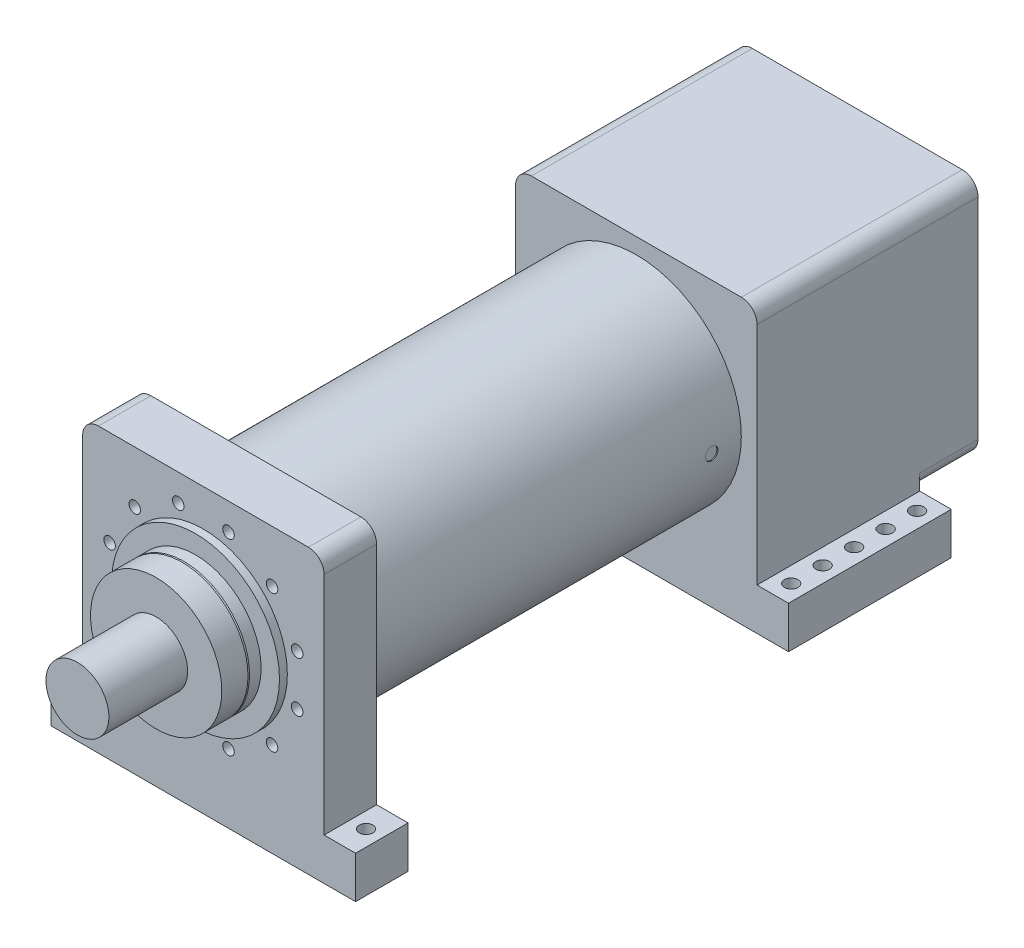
ISO-10303-21;
HEADER;
FILE_DESCRIPTION(('STEP AP214'),'2;1');
FILE_NAME('part.step','',(''),(''),'','','');
FILE_SCHEMA(('AUTOMOTIVE_DESIGN { 1 0 10303 214 1 1 1 1 }'));
ENDSEC;
DATA;
#1=APPLICATION_CONTEXT('core data for automotive mechanical design processes');
#2=APPLICATION_PROTOCOL_DEFINITION('international standard','automotive_design',2000,#1);
#3=PRODUCT_CONTEXT('',#1,'mechanical');
#4=PRODUCT('Part','Part','',(#3));
#5=PRODUCT_RELATED_PRODUCT_CATEGORY('part','',(#4));
#6=PRODUCT_DEFINITION_FORMATION('','',#4);
#7=PRODUCT_DEFINITION_CONTEXT('part definition',#1,'design');
#8=PRODUCT_DEFINITION('design','',#6,#7);
#9=PRODUCT_DEFINITION_SHAPE('','',#8);
#10=(LENGTH_UNIT() NAMED_UNIT(*) SI_UNIT(.MILLI.,.METRE.));
#11=(NAMED_UNIT(*) PLANE_ANGLE_UNIT() SI_UNIT($,.RADIAN.));
#12=(NAMED_UNIT(*) SI_UNIT($,.STERADIAN.) SOLID_ANGLE_UNIT());
#13=UNCERTAINTY_MEASURE_WITH_UNIT(LENGTH_MEASURE(1.E-05),#10,'distance_accuracy_value','');
#14=(GEOMETRIC_REPRESENTATION_CONTEXT(3) GLOBAL_UNCERTAINTY_ASSIGNED_CONTEXT((#13)) GLOBAL_UNIT_ASSIGNED_CONTEXT((#10,
#11,#12)) REPRESENTATION_CONTEXT('',''));
#15=CARTESIAN_POINT('',(0.,0.,0.));
#16=DIRECTION('',(0.,0.,1.));
#17=DIRECTION('',(1.,0.,0.));
#18=AXIS2_PLACEMENT_3D('',#15,#16,#17);
#19=CARTESIAN_POINT('',(0.,0.,1065.));
#20=DIRECTION('',(0.,0.,-1.));
#21=DIRECTION('',(-1.,0.,0.));
#22=AXIS2_PLACEMENT_3D('',#19,#20,#21);
#23=CYLINDRICAL_SURFACE('',#22,60.);
#24=CARTESIAN_POINT('',(0.,0.,1065.));
#25=DIRECTION('',(0.,0.,1.));
#26=DIRECTION('',(1.,0.,0.));
#27=AXIS2_PLACEMENT_3D('',#24,#25,#26);
#28=CIRCLE('',#27,60.);
#29=CARTESIAN_POINT('',(60.,0.,1065.));
#30=VERTEX_POINT('',#29);
#31=EDGE_CURVE('E11',#30,#30,#28,.T.);
#32=ORIENTED_EDGE('',*,*,#31,.F.);
#33=EDGE_LOOP('',(#32));
#34=FACE_BOUND('',#33,.T.);
#35=CARTESIAN_POINT('',(0.,0.,915.));
#36=DIRECTION('',(0.,0.,1.));
#37=DIRECTION('',(1.,0.,0.));
#38=AXIS2_PLACEMENT_3D('',#35,#36,#37);
#39=CIRCLE('',#38,60.);
#40=CARTESIAN_POINT('',(60.,0.,915.));
#41=VERTEX_POINT('',#40);
#42=EDGE_CURVE('E49',#41,#41,#39,.T.);
#43=ORIENTED_EDGE('',*,*,#42,.T.);
#44=EDGE_LOOP('',(#43));
#45=FACE_BOUND('',#44,.T.);
#46=ADVANCED_FACE('F46',(#34,#45),#23,.T.);
#47=CARTESIAN_POINT('',(0.,0.,1065.));
#48=DIRECTION('',(0.,0.,1.));
#49=DIRECTION('',(1.,0.,0.));
#50=AXIS2_PLACEMENT_3D('',#47,#48,#49);
#51=PLANE('',#50);
#52=ORIENTED_EDGE('',*,*,#31,.T.);
#53=EDGE_LOOP('',(#52));
#54=FACE_BOUND('',#53,.T.);
#55=ADVANCED_FACE('F61',(#54),#51,.T.);
#56=CARTESIAN_POINT('',(0.,0.,915.));
#57=DIRECTION('',(0.,0.,1.));
#58=DIRECTION('',(1.,0.,0.));
#59=AXIS2_PLACEMENT_3D('',#56,#57,#58);
#60=PLANE('',#59);
#61=ORIENTED_EDGE('',*,*,#42,.F.);
#62=EDGE_LOOP('',(#61));
#63=FACE_BOUND('',#62,.T.);
#64=ADVANCED_FACE('F59',(#63),#60,.F.);
#65=CLOSED_SHELL('',(#46,#55,#64));
#66=MANIFOLD_SOLID_BREP('B2',#65);
#67=CARTESIAN_POINT('',(0.,0.,915.));
#68=DIRECTION('',(0.,0.,-1.));
#69=DIRECTION('',(-1.,0.,0.));
#70=AXIS2_PLACEMENT_3D('',#67,#68,#69);
#71=CYLINDRICAL_SURFACE('',#70,125.);
#72=CARTESIAN_POINT('',(0.,0.,915.));
#73=DIRECTION('',(0.,0.,1.));
#74=DIRECTION('',(1.,0.,0.));
#75=AXIS2_PLACEMENT_3D('',#72,#73,#74);
#76=CIRCLE('',#75,125.);
#77=CARTESIAN_POINT('',(125.,0.,915.));
#78=VERTEX_POINT('',#77);
#79=EDGE_CURVE('E45',#78,#78,#76,.T.);
#80=ORIENTED_EDGE('',*,*,#79,.F.);
#81=EDGE_LOOP('',(#80));
#82=FACE_BOUND('',#81,.T.);
#83=CARTESIAN_POINT('',(0.,0.,865.));
#84=DIRECTION('',(0.,0.,1.));
#85=DIRECTION('',(1.,0.,0.));
#86=AXIS2_PLACEMENT_3D('',#83,#84,#85);
#87=CIRCLE('',#86,125.);
#88=CARTESIAN_POINT('',(125.,0.,865.));
#89=VERTEX_POINT('',#88);
#90=EDGE_CURVE('E99',#89,#89,#87,.T.);
#91=ORIENTED_EDGE('',*,*,#90,.T.);
#92=EDGE_LOOP('',(#91));
#93=FACE_BOUND('',#92,.T.);
#94=ADVANCED_FACE('F96',(#82,#93),#71,.T.);
#95=CARTESIAN_POINT('',(0.,0.,915.));
#96=DIRECTION('',(0.,0.,1.));
#97=DIRECTION('',(1.,0.,0.));
#98=AXIS2_PLACEMENT_3D('',#95,#96,#97);
#99=PLANE('',#98);
#100=ORIENTED_EDGE('',*,*,#79,.T.);
#101=EDGE_LOOP('',(#100));
#102=FACE_BOUND('',#101,.T.);
#103=ADVANCED_FACE('F111',(#102),#99,.T.);
#104=CARTESIAN_POINT('',(0.,0.,865.));
#105=DIRECTION('',(0.,0.,1.));
#106=DIRECTION('',(1.,0.,0.));
#107=AXIS2_PLACEMENT_3D('',#104,#105,#106);
#108=PLANE('',#107);
#109=ORIENTED_EDGE('',*,*,#90,.F.);
#110=EDGE_LOOP('',(#109));
#111=FACE_BOUND('',#110,.T.);
#112=ADVANCED_FACE('F109',(#111),#108,.F.);
#113=CLOSED_SHELL('',(#94,#103,#112));
#114=MANIFOLD_SOLID_BREP('B6',#113);
#115=CARTESIAN_POINT('',(0.,-230.,0.));
#116=DIRECTION('',(0.,1.,0.));
#117=DIRECTION('',(0.,0.,1.));
#118=AXIS2_PLACEMENT_3D('',#115,#116,#117);
#119=PLANE('',#118);
#120=CARTESIAN_POINT('',(-260.,-230.,-95.));
#121=DIRECTION('',(0.,-1.,0.));
#122=DIRECTION('',(0.,0.,-1.));
#123=AXIS2_PLACEMENT_3D('',#120,#121,#122);
#124=CIRCLE('',#123,13.);
#125=CARTESIAN_POINT('',(-260.,-230.,-108.));
#126=VERTEX_POINT('',#125);
#127=EDGE_CURVE('E844',#126,#126,#124,.T.);
#128=ORIENTED_EDGE('',*,*,#127,.T.);
#129=EDGE_LOOP('',(#128));
#130=FACE_BOUND('',#129,.T.);
#131=CARTESIAN_POINT('',(-260.,-230.,-215.));
#132=DIRECTION('',(0.,-1.,0.));
#133=DIRECTION('',(0.,0.,-1.));
#134=AXIS2_PLACEMENT_3D('',#131,#132,#133);
#135=CIRCLE('',#134,13.);
#136=CARTESIAN_POINT('',(-260.,-230.,-228.));
#137=VERTEX_POINT('',#136);
#138=EDGE_CURVE('E828',#137,#137,#135,.T.);
#139=ORIENTED_EDGE('',*,*,#138,.T.);
#140=EDGE_LOOP('',(#139));
#141=FACE_BOUND('',#140,.T.);
#142=CARTESIAN_POINT('',(-260.,-230.,-275.));
#143=DIRECTION('',(0.,-1.,0.));
#144=DIRECTION('',(0.,0.,-1.));
#145=AXIS2_PLACEMENT_3D('',#142,#143,#144);
#146=CIRCLE('',#145,13.);
#147=CARTESIAN_POINT('',(-260.,-230.,-288.));
#148=VERTEX_POINT('',#147);
#149=EDGE_CURVE('E820',#148,#148,#146,.T.);
#150=ORIENTED_EDGE('',*,*,#149,.T.);
#151=EDGE_LOOP('',(#150));
#152=FACE_BOUND('',#151,.T.);
#153=CARTESIAN_POINT('',(-260.,-230.,-155.));
#154=DIRECTION('',(0.,-1.,0.));
#155=DIRECTION('',(0.,0.,-1.));
#156=AXIS2_PLACEMENT_3D('',#153,#154,#155);
#157=CIRCLE('',#156,13.);
#158=CARTESIAN_POINT('',(-260.,-230.,-168.));
#159=VERTEX_POINT('',#158);
#160=EDGE_CURVE('E836',#159,#159,#157,.T.);
#161=ORIENTED_EDGE('',*,*,#160,.T.);
#162=EDGE_LOOP('',(#161));
#163=FACE_BOUND('',#162,.T.);
#164=CARTESIAN_POINT('',(-260.,-230.,-35.));
#165=DIRECTION('',(0.,-1.,0.));
#166=DIRECTION('',(0.,0.,-1.));
#167=AXIS2_PLACEMENT_3D('',#164,#165,#166);
#168=CIRCLE('',#167,13.);
#169=CARTESIAN_POINT('',(-260.,-230.,-48.));
#170=VERTEX_POINT('',#169);
#171=EDGE_CURVE('E851',#170,#170,#168,.T.);
#172=ORIENTED_EDGE('',*,*,#171,.T.);
#173=EDGE_LOOP('',(#172));
#174=FACE_BOUND('',#173,.T.);
#175=DIRECTION('',(-1.,0.,0.));
#176=VECTOR('',#175,1.);
#177=CARTESIAN_POINT('',(-290.,-230.,0.));
#178=LINE('',#177,#176);
#179=CARTESIAN_POINT('',(-230.,-230.,0.));
#180=VERTEX_POINT('',#179);
#181=CARTESIAN_POINT('',(-290.,-230.,0.));
#182=VERTEX_POINT('',#181);
#183=EDGE_CURVE('E795',#180,#182,#178,.T.);
#184=ORIENTED_EDGE('',*,*,#183,.F.);
#185=DIRECTION('',(0.,0.,1.));
#186=VECTOR('',#185,1.);
#187=CARTESIAN_POINT('',(-230.,-230.,-310.));
#188=LINE('',#187,#186);
#189=CARTESIAN_POINT('',(-230.,-230.,-310.));
#190=VERTEX_POINT('',#189);
#191=EDGE_CURVE('E770',#190,#180,#188,.T.);
#192=ORIENTED_EDGE('',*,*,#191,.F.);
#193=DIRECTION('',(1.,0.,0.));
#194=VECTOR('',#193,1.);
#195=CARTESIAN_POINT('',(-290.,-230.,-310.));
#196=LINE('',#195,#194);
#197=CARTESIAN_POINT('',(-290.,-230.,-310.));
#198=VERTEX_POINT('',#197);
#199=EDGE_CURVE('E799',#198,#190,#196,.T.);
#200=ORIENTED_EDGE('',*,*,#199,.F.);
#201=DIRECTION('',(0.,0.,-1.));
#202=VECTOR('',#201,1.);
#203=CARTESIAN_POINT('',(-290.,-230.,-310.));
#204=LINE('',#203,#202);
#205=EDGE_CURVE('E804',#182,#198,#204,.T.);
#206=ORIENTED_EDGE('',*,*,#205,.F.);
#207=EDGE_LOOP('',(#184,#192,#200,#206));
#208=FACE_BOUND('',#207,.T.);
#209=ADVANCED_FACE('F137',(#130,#141,#152,#163,#174,#208),#119,.T.);
#210=CARTESIAN_POINT('',(260.,-230.,-215.));
#211=DIRECTION('',(0.,-1.,0.));
#212=DIRECTION('',(0.,0.,1.));
#213=AXIS2_PLACEMENT_3D('',#210,#211,#212);
#214=CIRCLE('',#213,13.);
#215=CARTESIAN_POINT('',(260.,-230.,-202.));
#216=VERTEX_POINT('',#215);
#217=EDGE_CURVE('E883',#216,#216,#214,.T.);
#218=ORIENTED_EDGE('',*,*,#217,.T.);
#219=EDGE_LOOP('',(#218));
#220=FACE_BOUND('',#219,.T.);
#221=CARTESIAN_POINT('',(260.,-230.,-95.));
#222=DIRECTION('',(0.,-1.,0.));
#223=DIRECTION('',(0.,0.,1.));
#224=AXIS2_PLACEMENT_3D('',#221,#222,#223);
#225=CIRCLE('',#224,13.);
#226=CARTESIAN_POINT('',(260.,-230.,-82.));
#227=VERTEX_POINT('',#226);
#228=EDGE_CURVE('E867',#227,#227,#225,.T.);
#229=ORIENTED_EDGE('',*,*,#228,.T.);
#230=EDGE_LOOP('',(#229));
#231=FACE_BOUND('',#230,.T.);
#232=CARTESIAN_POINT('',(260.,-230.,-35.));
#233=DIRECTION('',(0.,-1.,0.));
#234=DIRECTION('',(0.,0.,1.));
#235=AXIS2_PLACEMENT_3D('',#232,#233,#234);
#236=CIRCLE('',#235,13.);
#237=CARTESIAN_POINT('',(260.,-230.,-22.));
#238=VERTEX_POINT('',#237);
#239=EDGE_CURVE('E859',#238,#238,#236,.T.);
#240=ORIENTED_EDGE('',*,*,#239,.T.);
#241=EDGE_LOOP('',(#240));
#242=FACE_BOUND('',#241,.T.);
#243=CARTESIAN_POINT('',(260.,-230.,-155.));
#244=DIRECTION('',(0.,-1.,0.));
#245=DIRECTION('',(0.,0.,1.));
#246=AXIS2_PLACEMENT_3D('',#243,#244,#245);
#247=CIRCLE('',#246,13.);
#248=CARTESIAN_POINT('',(260.,-230.,-142.));
#249=VERTEX_POINT('',#248);
#250=EDGE_CURVE('E875',#249,#249,#247,.T.);
#251=ORIENTED_EDGE('',*,*,#250,.T.);
#252=EDGE_LOOP('',(#251));
#253=FACE_BOUND('',#252,.T.);
#254=CARTESIAN_POINT('',(260.,-230.,-275.));
#255=DIRECTION('',(0.,-1.,0.));
#256=DIRECTION('',(0.,0.,1.));
#257=AXIS2_PLACEMENT_3D('',#254,#255,#256);
#258=CIRCLE('',#257,13.0000000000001);
#259=CARTESIAN_POINT('',(260.,-230.,-262.));
#260=VERTEX_POINT('',#259);
#261=EDGE_CURVE('E891',#260,#260,#258,.T.);
#262=ORIENTED_EDGE('',*,*,#261,.T.);
#263=EDGE_LOOP('',(#262));
#264=FACE_BOUND('',#263,.T.);
#265=DIRECTION('',(0.,0.,1.));
#266=VECTOR('',#265,1.);
#267=CARTESIAN_POINT('',(230.,-230.,-310.));
#268=LINE('',#267,#266);
#269=CARTESIAN_POINT('',(230.,-230.,-310.));
#270=VERTEX_POINT('',#269);
#271=CARTESIAN_POINT('',(230.,-230.,0.));
#272=VERTEX_POINT('',#271);
#273=EDGE_CURVE('E753',#270,#272,#268,.T.);
#274=ORIENTED_EDGE('',*,*,#273,.T.);
#275=CARTESIAN_POINT('',(290.,-230.,0.));
#276=VERTEX_POINT('',#275);
#277=EDGE_CURVE('E790',#276,#272,#178,.T.);
#278=ORIENTED_EDGE('',*,*,#277,.F.);
#279=DIRECTION('',(0.,0.,1.));
#280=VECTOR('',#279,1.);
#281=CARTESIAN_POINT('',(290.,-230.,-310.));
#282=LINE('',#281,#280);
#283=CARTESIAN_POINT('',(290.,-230.,-310.));
#284=VERTEX_POINT('',#283);
#285=EDGE_CURVE('E796',#284,#276,#282,.T.);
#286=ORIENTED_EDGE('',*,*,#285,.F.);
#287=EDGE_CURVE('E803',#270,#284,#196,.T.);
#288=ORIENTED_EDGE('',*,*,#287,.F.);
#289=EDGE_LOOP('',(#274,#278,#286,#288));
#290=FACE_BOUND('',#289,.T.);
#291=ADVANCED_FACE('F611',(#220,#231,#242,#253,#264,#290),#119,.T.);
#292=CARTESIAN_POINT('',(-230.,230.,-310.));
#293=DIRECTION('',(1.,0.,0.));
#294=DIRECTION('',(0.,0.,-1.));
#295=AXIS2_PLACEMENT_3D('',#292,#293,#294);
#296=PLANE('',#295);
#297=DIRECTION('',(0.,1.,0.));
#298=VECTOR('',#297,1.);
#299=CARTESIAN_POINT('',(-230.,230.,-421.));
#300=LINE('',#299,#298);
#301=CARTESIAN_POINT('',(-230.,-200.,-421.));
#302=VERTEX_POINT('',#301);
#303=CARTESIAN_POINT('',(-230.,200.,-421.));
#304=VERTEX_POINT('',#303);
#305=EDGE_CURVE('E901',#302,#304,#300,.T.);
#306=ORIENTED_EDGE('',*,*,#305,.F.);
#307=DIRECTION('',(0.,0.,1.));
#308=VECTOR('',#307,1.);
#309=CARTESIAN_POINT('',(-230.,-200.,-310.));
#310=LINE('',#309,#308);
#311=CARTESIAN_POINT('',(-230.,-200.,-310.));
#312=VERTEX_POINT('',#311);
#313=EDGE_CURVE('E704',#302,#312,#310,.T.);
#314=ORIENTED_EDGE('',*,*,#313,.T.);
#315=DIRECTION('',(0.,-1.,0.));
#316=VECTOR('',#315,1.);
#317=CARTESIAN_POINT('',(-230.,0.,-310.));
#318=LINE('',#317,#316);
#319=EDGE_CURVE('E701',#312,#190,#318,.T.);
#320=ORIENTED_EDGE('',*,*,#319,.T.);
#321=ORIENTED_EDGE('',*,*,#191,.T.);
#322=DIRECTION('',(0.,1.,0.));
#323=VECTOR('',#322,1.);
#324=CARTESIAN_POINT('',(-230.,230.,0.));
#325=LINE('',#324,#323);
#326=CARTESIAN_POINT('',(-230.,200.,0.));
#327=VERTEX_POINT('',#326);
#328=EDGE_CURVE('E359',#180,#327,#325,.T.);
#329=ORIENTED_EDGE('',*,*,#328,.T.);
#330=DIRECTION('',(0.,0.,1.));
#331=VECTOR('',#330,1.);
#332=CARTESIAN_POINT('',(-230.,200.,-310.));
#333=LINE('',#332,#331);
#334=EDGE_CURVE('E698',#327,#304,#333,.F.);
#335=ORIENTED_EDGE('',*,*,#334,.T.);
#336=EDGE_LOOP('',(#306,#314,#320,#321,#329,#335));
#337=FACE_BOUND('',#336,.T.);
#338=ADVANCED_FACE('F617',(#337),#296,.F.);
#339=CARTESIAN_POINT('',(230.,230.,-310.));
#340=DIRECTION('',(0.,-1.,0.));
#341=DIRECTION('',(0.,0.,-1.));
#342=AXIS2_PLACEMENT_3D('',#339,#340,#341);
#343=PLANE('',#342);
#344=DIRECTION('',(1.,0.,0.));
#345=VECTOR('',#344,1.);
#346=CARTESIAN_POINT('',(230.,230.,0.));
#347=LINE('',#346,#345);
#348=CARTESIAN_POINT('',(-200.,230.,0.));
#349=VERTEX_POINT('',#348);
#350=CARTESIAN_POINT('',(200.,230.,0.));
#351=VERTEX_POINT('',#350);
#352=EDGE_CURVE('E366',#349,#351,#347,.T.);
#353=ORIENTED_EDGE('',*,*,#352,.T.);
#354=DIRECTION('',(0.,0.,1.));
#355=VECTOR('',#354,1.);
#356=CARTESIAN_POINT('',(200.,230.,-310.));
#357=LINE('',#356,#355);
#358=CARTESIAN_POINT('',(200.,230.,-421.));
#359=VERTEX_POINT('',#358);
#360=EDGE_CURVE('E678',#351,#359,#357,.F.);
#361=ORIENTED_EDGE('',*,*,#360,.T.);
#362=DIRECTION('',(1.,0.,0.));
#363=VECTOR('',#362,1.);
#364=CARTESIAN_POINT('',(230.,230.,-421.));
#365=LINE('',#364,#363);
#366=CARTESIAN_POINT('',(-200.,230.,-421.));
#367=VERTEX_POINT('',#366);
#368=EDGE_CURVE('E909',#367,#359,#365,.T.);
#369=ORIENTED_EDGE('',*,*,#368,.F.);
#370=DIRECTION('',(0.,0.,1.));
#371=VECTOR('',#370,1.);
#372=CARTESIAN_POINT('',(-200.,230.,-310.));
#373=LINE('',#372,#371);
#374=EDGE_CURVE('E739',#367,#349,#373,.T.);
#375=ORIENTED_EDGE('',*,*,#374,.T.);
#376=EDGE_LOOP('',(#353,#361,#369,#375));
#377=FACE_BOUND('',#376,.T.);
#378=ADVANCED_FACE('F643',(#377),#343,.F.);
#379=CARTESIAN_POINT('',(230.,230.,-310.));
#380=DIRECTION('',(-1.,0.,0.));
#381=DIRECTION('',(0.,0.,1.));
#382=AXIS2_PLACEMENT_3D('',#379,#380,#381);
#383=PLANE('',#382);
#384=ORIENTED_EDGE('',*,*,#273,.F.);
#385=DIRECTION('',(0.,1.,0.));
#386=VECTOR('',#385,1.);
#387=CARTESIAN_POINT('',(230.,0.,-310.));
#388=LINE('',#387,#386);
#389=CARTESIAN_POINT('',(230.,-200.,-310.));
#390=VERTEX_POINT('',#389);
#391=EDGE_CURVE('E153',#270,#390,#388,.T.);
#392=ORIENTED_EDGE('',*,*,#391,.T.);
#393=DIRECTION('',(0.,0.,1.));
#394=VECTOR('',#393,1.);
#395=CARTESIAN_POINT('',(230.,-200.,-310.));
#396=LINE('',#395,#394);
#397=CARTESIAN_POINT('',(230.,-200.,-421.));
#398=VERTEX_POINT('',#397);
#399=EDGE_CURVE('E751',#390,#398,#396,.F.);
#400=ORIENTED_EDGE('',*,*,#399,.T.);
#401=DIRECTION('',(0.,-1.,0.));
#402=VECTOR('',#401,1.);
#403=CARTESIAN_POINT('',(230.,230.,-421.));
#404=LINE('',#403,#402);
#405=CARTESIAN_POINT('',(230.,200.,-421.));
#406=VERTEX_POINT('',#405);
#407=EDGE_CURVE('E906',#406,#398,#404,.T.);
#408=ORIENTED_EDGE('',*,*,#407,.F.);
#409=DIRECTION('',(0.,0.,1.));
#410=VECTOR('',#409,1.);
#411=CARTESIAN_POINT('',(230.,200.,-310.));
#412=LINE('',#411,#410);
#413=CARTESIAN_POINT('',(230.,200.,0.));
#414=VERTEX_POINT('',#413);
#415=EDGE_CURVE('E680',#406,#414,#412,.T.);
#416=ORIENTED_EDGE('',*,*,#415,.T.);
#417=DIRECTION('',(0.,-1.,0.));
#418=VECTOR('',#417,1.);
#419=CARTESIAN_POINT('',(230.,230.,0.));
#420=LINE('',#419,#418);
#421=EDGE_CURVE('E369',#414,#272,#420,.T.);
#422=ORIENTED_EDGE('',*,*,#421,.T.);
#423=EDGE_LOOP('',(#384,#392,#400,#408,#416,#422));
#424=FACE_BOUND('',#423,.T.);
#425=ADVANCED_FACE('F640',(#424),#383,.F.);
#426=CARTESIAN_POINT('',(0.,0.,-310.));
#427=DIRECTION('',(0.,0.,-1.));
#428=DIRECTION('',(-1.,0.,0.));
#429=AXIS2_PLACEMENT_3D('',#426,#427,#428);
#430=PLANE('',#429);
#431=DIRECTION('',(-1.,0.,0.));
#432=VECTOR('',#431,1.);
#433=CARTESIAN_POINT('',(230.,-230.,-310.));
#434=LINE('',#433,#432);
#435=CARTESIAN_POINT('',(200.,-230.,-310.));
#436=VERTEX_POINT('',#435);
#437=CARTESIAN_POINT('',(-200.,-230.,-310.));
#438=VERTEX_POINT('',#437);
#439=EDGE_CURVE('E747',#436,#438,#434,.T.);
#440=ORIENTED_EDGE('',*,*,#439,.F.);
#441=CARTESIAN_POINT('',(200.,-200.,-310.));
#442=DIRECTION('',(0.,0.,-1.));
#443=DIRECTION('',(-1.,0.,0.));
#444=AXIS2_PLACEMENT_3D('',#441,#442,#443);
#445=CIRCLE('',#444,30.);
#446=EDGE_CURVE('E146',#436,#390,#445,.F.);
#447=ORIENTED_EDGE('',*,*,#446,.T.);
#448=ORIENTED_EDGE('',*,*,#391,.F.);
#449=ORIENTED_EDGE('',*,*,#287,.T.);
#450=DIRECTION('',(0.,1.,0.));
#451=VECTOR('',#450,1.);
#452=CARTESIAN_POINT('',(290.,-310.,-310.));
#453=LINE('',#452,#451);
#454=CARTESIAN_POINT('',(290.,-310.,-310.));
#455=VERTEX_POINT('',#454);
#456=EDGE_CURVE('E777',#455,#284,#453,.T.);
#457=ORIENTED_EDGE('',*,*,#456,.F.);
#458=DIRECTION('',(1.,0.,0.));
#459=VECTOR('',#458,1.);
#460=CARTESIAN_POINT('',(-290.,-310.,-310.));
#461=LINE('',#460,#459);
#462=CARTESIAN_POINT('',(-290.,-310.,-310.));
#463=VERTEX_POINT('',#462);
#464=EDGE_CURVE('E814',#463,#455,#461,.T.);
#465=ORIENTED_EDGE('',*,*,#464,.F.);
#466=DIRECTION('',(0.,1.,0.));
#467=VECTOR('',#466,1.);
#468=CARTESIAN_POINT('',(-290.,-310.,-310.));
#469=LINE('',#468,#467);
#470=EDGE_CURVE('E773',#463,#198,#469,.T.);
#471=ORIENTED_EDGE('',*,*,#470,.T.);
#472=ORIENTED_EDGE('',*,*,#199,.T.);
#473=ORIENTED_EDGE('',*,*,#319,.F.);
#474=CARTESIAN_POINT('',(-200.,-200.,-310.));
#475=DIRECTION('',(0.,0.,-1.));
#476=DIRECTION('',(-1.,0.,0.));
#477=AXIS2_PLACEMENT_3D('',#474,#475,#476);
#478=CIRCLE('',#477,30.);
#479=EDGE_CURVE('E94',#312,#438,#478,.F.);
#480=ORIENTED_EDGE('',*,*,#479,.T.);
#481=EDGE_LOOP('',(#440,#447,#448,#449,#457,#465,#471,#472,#473,#480));
#482=FACE_BOUND('',#481,.T.);
#483=ADVANCED_FACE('F637',(#482),#430,.T.);
#484=CARTESIAN_POINT('',(0.,-310.,0.));
#485=DIRECTION('',(0.,1.,0.));
#486=DIRECTION('',(0.,0.,1.));
#487=AXIS2_PLACEMENT_3D('',#484,#485,#486);
#488=PLANE('',#487);
#489=DIRECTION('',(0.,0.,-1.));
#490=VECTOR('',#489,1.);
#491=CARTESIAN_POINT('',(-290.,-310.,-310.));
#492=LINE('',#491,#490);
#493=CARTESIAN_POINT('',(-290.,-310.,0.));
#494=VERTEX_POINT('',#493);
#495=EDGE_CURVE('E794',#494,#463,#492,.T.);
#496=ORIENTED_EDGE('',*,*,#495,.T.);
#497=ORIENTED_EDGE('',*,*,#464,.T.);
#498=DIRECTION('',(0.,0.,1.));
#499=VECTOR('',#498,1.);
#500=CARTESIAN_POINT('',(290.,-310.,-310.));
#501=LINE('',#500,#499);
#502=CARTESIAN_POINT('',(290.,-310.,0.));
#503=VERTEX_POINT('',#502);
#504=EDGE_CURVE('E811',#455,#503,#501,.T.);
#505=ORIENTED_EDGE('',*,*,#504,.T.);
#506=DIRECTION('',(-1.,0.,0.));
#507=VECTOR('',#506,1.);
#508=CARTESIAN_POINT('',(-290.,-310.,0.));
#509=LINE('',#508,#507);
#510=EDGE_CURVE('E789',#503,#494,#509,.T.);
#511=ORIENTED_EDGE('',*,*,#510,.T.);
#512=EDGE_LOOP('',(#496,#497,#505,#511));
#513=FACE_BOUND('',#512,.T.);
#514=CARTESIAN_POINT('',(-260.,-310.,-275.));
#515=DIRECTION('',(0.,-1.,0.));
#516=DIRECTION('',(0.,0.,-1.));
#517=AXIS2_PLACEMENT_3D('',#514,#515,#516);
#518=CIRCLE('',#517,13.);
#519=CARTESIAN_POINT('',(-260.,-310.,-288.));
#520=VERTEX_POINT('',#519);
#521=EDGE_CURVE('E808',#520,#520,#518,.T.);
#522=ORIENTED_EDGE('',*,*,#521,.F.);
#523=EDGE_LOOP('',(#522));
#524=FACE_BOUND('',#523,.T.);
#525=CARTESIAN_POINT('',(-260.,-310.,-215.));
#526=DIRECTION('',(0.,-1.,0.));
#527=DIRECTION('',(0.,0.,-1.));
#528=AXIS2_PLACEMENT_3D('',#525,#526,#527);
#529=CIRCLE('',#528,13.);
#530=CARTESIAN_POINT('',(-260.,-310.,-228.));
#531=VERTEX_POINT('',#530);
#532=EDGE_CURVE('E824',#531,#531,#529,.T.);
#533=ORIENTED_EDGE('',*,*,#532,.F.);
#534=EDGE_LOOP('',(#533));
#535=FACE_BOUND('',#534,.T.);
#536=CARTESIAN_POINT('',(-260.,-310.,-155.));
#537=DIRECTION('',(0.,-1.,0.));
#538=DIRECTION('',(0.,0.,-1.));
#539=AXIS2_PLACEMENT_3D('',#536,#537,#538);
#540=CIRCLE('',#539,13.);
#541=CARTESIAN_POINT('',(-260.,-310.,-168.));
#542=VERTEX_POINT('',#541);
#543=EDGE_CURVE('E832',#542,#542,#540,.T.);
#544=ORIENTED_EDGE('',*,*,#543,.F.);
#545=EDGE_LOOP('',(#544));
#546=FACE_BOUND('',#545,.T.);
#547=CARTESIAN_POINT('',(-260.,-310.,-95.));
#548=DIRECTION('',(0.,-1.,0.));
#549=DIRECTION('',(0.,0.,-1.));
#550=AXIS2_PLACEMENT_3D('',#547,#548,#549);
#551=CIRCLE('',#550,13.);
#552=CARTESIAN_POINT('',(-260.,-310.,-108.));
#553=VERTEX_POINT('',#552);
#554=EDGE_CURVE('E840',#553,#553,#551,.T.);
#555=ORIENTED_EDGE('',*,*,#554,.F.);
#556=EDGE_LOOP('',(#555));
#557=FACE_BOUND('',#556,.T.);
#558=CARTESIAN_POINT('',(-260.,-310.,-35.));
#559=DIRECTION('',(0.,-1.,0.));
#560=DIRECTION('',(0.,0.,-1.));
#561=AXIS2_PLACEMENT_3D('',#558,#559,#560);
#562=CIRCLE('',#561,13.);
#563=CARTESIAN_POINT('',(-260.,-310.,-48.));
#564=VERTEX_POINT('',#563);
#565=EDGE_CURVE('E847',#564,#564,#562,.T.);
#566=ORIENTED_EDGE('',*,*,#565,.F.);
#567=EDGE_LOOP('',(#566));
#568=FACE_BOUND('',#567,.T.);
#569=CARTESIAN_POINT('',(260.,-310.,-35.));
#570=DIRECTION('',(0.,-1.,0.));
#571=DIRECTION('',(0.,0.,1.));
#572=AXIS2_PLACEMENT_3D('',#569,#570,#571);
#573=CIRCLE('',#572,13.);
#574=CARTESIAN_POINT('',(260.,-310.,-22.));
#575=VERTEX_POINT('',#574);
#576=EDGE_CURVE('E855',#575,#575,#573,.T.);
#577=ORIENTED_EDGE('',*,*,#576,.F.);
#578=EDGE_LOOP('',(#577));
#579=FACE_BOUND('',#578,.T.);
#580=CARTESIAN_POINT('',(260.,-310.,-95.));
#581=DIRECTION('',(0.,-1.,0.));
#582=DIRECTION('',(0.,0.,1.));
#583=AXIS2_PLACEMENT_3D('',#580,#581,#582);
#584=CIRCLE('',#583,13.);
#585=CARTESIAN_POINT('',(260.,-310.,-82.));
#586=VERTEX_POINT('',#585);
#587=EDGE_CURVE('E863',#586,#586,#584,.T.);
#588=ORIENTED_EDGE('',*,*,#587,.F.);
#589=EDGE_LOOP('',(#588));
#590=FACE_BOUND('',#589,.T.);
#591=CARTESIAN_POINT('',(260.,-310.,-155.));
#592=DIRECTION('',(0.,-1.,0.));
#593=DIRECTION('',(0.,0.,1.));
#594=AXIS2_PLACEMENT_3D('',#591,#592,#593);
#595=CIRCLE('',#594,13.);
#596=CARTESIAN_POINT('',(260.,-310.,-142.));
#597=VERTEX_POINT('',#596);
#598=EDGE_CURVE('E871',#597,#597,#595,.T.);
#599=ORIENTED_EDGE('',*,*,#598,.F.);
#600=EDGE_LOOP('',(#599));
#601=FACE_BOUND('',#600,.T.);
#602=CARTESIAN_POINT('',(260.,-310.,-215.));
#603=DIRECTION('',(0.,-1.,0.));
#604=DIRECTION('',(0.,0.,1.));
#605=AXIS2_PLACEMENT_3D('',#602,#603,#604);
#606=CIRCLE('',#605,13.);
#607=CARTESIAN_POINT('',(260.,-310.,-202.));
#608=VERTEX_POINT('',#607);
#609=EDGE_CURVE('E879',#608,#608,#606,.T.);
#610=ORIENTED_EDGE('',*,*,#609,.F.);
#611=EDGE_LOOP('',(#610));
#612=FACE_BOUND('',#611,.T.);
#613=CARTESIAN_POINT('',(260.,-310.,-275.));
#614=DIRECTION('',(0.,-1.,0.));
#615=DIRECTION('',(0.,0.,1.));
#616=AXIS2_PLACEMENT_3D('',#613,#614,#615);
#617=CIRCLE('',#616,13.0000000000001);
#618=CARTESIAN_POINT('',(260.,-310.,-262.));
#619=VERTEX_POINT('',#618);
#620=EDGE_CURVE('E887',#619,#619,#617,.T.);
#621=ORIENTED_EDGE('',*,*,#620,.F.);
#622=EDGE_LOOP('',(#621));
#623=FACE_BOUND('',#622,.T.);
#624=ADVANCED_FACE('F623',(#513,#524,#535,#546,#557,#568,#579,#590,#601,#612,#623),#488,.F.);
#625=CARTESIAN_POINT('',(-290.,-310.,-310.));
#626=DIRECTION('',(1.,0.,0.));
#627=DIRECTION('',(0.,0.,-1.));
#628=AXIS2_PLACEMENT_3D('',#625,#626,#627);
#629=PLANE('',#628);
#630=ORIENTED_EDGE('',*,*,#205,.T.);
#631=ORIENTED_EDGE('',*,*,#470,.F.);
#632=ORIENTED_EDGE('',*,*,#495,.F.);
#633=DIRECTION('',(0.,1.,0.));
#634=VECTOR('',#633,1.);
#635=CARTESIAN_POINT('',(-290.,-310.,0.));
#636=LINE('',#635,#634);
#637=EDGE_CURVE('E785',#494,#182,#636,.T.);
#638=ORIENTED_EDGE('',*,*,#637,.T.);
#639=EDGE_LOOP('',(#630,#631,#632,#638));
#640=FACE_BOUND('',#639,.T.);
#641=ADVANCED_FACE('F632',(#640),#629,.F.);
#642=CARTESIAN_POINT('',(290.,-310.,-310.));
#643=DIRECTION('',(-1.,0.,0.));
#644=DIRECTION('',(0.,0.,1.));
#645=AXIS2_PLACEMENT_3D('',#642,#643,#644);
#646=PLANE('',#645);
#647=ORIENTED_EDGE('',*,*,#285,.T.);
#648=DIRECTION('',(0.,1.,0.));
#649=VECTOR('',#648,1.);
#650=CARTESIAN_POINT('',(290.,-310.,0.));
#651=LINE('',#650,#649);
#652=EDGE_CURVE('E781',#503,#276,#651,.T.);
#653=ORIENTED_EDGE('',*,*,#652,.F.);
#654=ORIENTED_EDGE('',*,*,#504,.F.);
#655=ORIENTED_EDGE('',*,*,#456,.T.);
#656=EDGE_LOOP('',(#647,#653,#654,#655));
#657=FACE_BOUND('',#656,.T.);
#658=ADVANCED_FACE('F629',(#657),#646,.F.);
#659=CARTESIAN_POINT('',(-290.,-310.,0.));
#660=DIRECTION('',(0.,0.,-1.));
#661=DIRECTION('',(-1.,0.,0.));
#662=AXIS2_PLACEMENT_3D('',#659,#660,#661);
#663=PLANE('',#662);
#664=ORIENTED_EDGE('',*,*,#421,.F.);
#665=CARTESIAN_POINT('',(200.,200.,0.));
#666=DIRECTION('',(0.,0.,-1.));
#667=DIRECTION('',(-1.,0.,0.));
#668=AXIS2_PLACEMENT_3D('',#665,#666,#667);
#669=CIRCLE('',#668,30.);
#670=EDGE_CURVE('E161',#414,#351,#669,.F.);
#671=ORIENTED_EDGE('',*,*,#670,.T.);
#672=ORIENTED_EDGE('',*,*,#352,.F.);
#673=CARTESIAN_POINT('',(-200.,200.,0.));
#674=DIRECTION('',(0.,0.,-1.));
#675=DIRECTION('',(-1.,0.,0.));
#676=AXIS2_PLACEMENT_3D('',#673,#674,#675);
#677=CIRCLE('',#676,30.);
#678=EDGE_CURVE('E734',#349,#327,#677,.F.);
#679=ORIENTED_EDGE('',*,*,#678,.T.);
#680=ORIENTED_EDGE('',*,*,#328,.F.);
#681=ORIENTED_EDGE('',*,*,#183,.T.);
#682=ORIENTED_EDGE('',*,*,#637,.F.);
#683=ORIENTED_EDGE('',*,*,#510,.F.);
#684=ORIENTED_EDGE('',*,*,#652,.T.);
#685=ORIENTED_EDGE('',*,*,#277,.T.);
#686=EDGE_LOOP('',(#664,#671,#672,#679,#680,#681,#682,#683,#684,#685));
#687=FACE_BOUND('',#686,.T.);
#688=CARTESIAN_POINT('',(0.,0.,0.));
#689=DIRECTION('',(0.,0.,1.));
#690=DIRECTION('',(1.,0.,0.));
#691=AXIS2_PLACEMENT_3D('',#688,#689,#690);
#692=CIRCLE('',#691,200.);
#693=CARTESIAN_POINT('',(200.,0.,0.));
#694=VERTEX_POINT('',#693);
#695=EDGE_CURVE('E372',#694,#694,#692,.T.);
#696=ORIENTED_EDGE('',*,*,#695,.F.);
#697=EDGE_LOOP('',(#696));
#698=FACE_BOUND('',#697,.T.);
#699=ADVANCED_FACE('F625',(#687,#698),#663,.F.);
#700=CARTESIAN_POINT('',(-260.,-310.,-275.));
#701=DIRECTION('',(0.,1.,0.));
#702=DIRECTION('',(0.,0.,1.));
#703=AXIS2_PLACEMENT_3D('',#700,#701,#702);
#704=CYLINDRICAL_SURFACE('',#703,13.);
#705=ORIENTED_EDGE('',*,*,#521,.T.);
#706=EDGE_LOOP('',(#705));
#707=FACE_BOUND('',#706,.T.);
#708=ORIENTED_EDGE('',*,*,#149,.F.);
#709=EDGE_LOOP('',(#708));
#710=FACE_BOUND('',#709,.T.);
#711=ADVANCED_FACE('F628',(#707,#710),#704,.F.);
#712=CARTESIAN_POINT('',(-260.,-310.,-215.));
#713=DIRECTION('',(0.,1.,0.));
#714=DIRECTION('',(0.,0.,1.));
#715=AXIS2_PLACEMENT_3D('',#712,#713,#714);
#716=CYLINDRICAL_SURFACE('',#715,13.);
#717=ORIENTED_EDGE('',*,*,#532,.T.);
#718=EDGE_LOOP('',(#717));
#719=FACE_BOUND('',#718,.T.);
#720=ORIENTED_EDGE('',*,*,#138,.F.);
#721=EDGE_LOOP('',(#720));
#722=FACE_BOUND('',#721,.T.);
#723=ADVANCED_FACE('F1022',(#719,#722),#716,.F.);
#724=CARTESIAN_POINT('',(-260.,-310.,-155.));
#725=DIRECTION('',(0.,1.,0.));
#726=DIRECTION('',(0.,0.,1.));
#727=AXIS2_PLACEMENT_3D('',#724,#725,#726);
#728=CYLINDRICAL_SURFACE('',#727,13.);
#729=ORIENTED_EDGE('',*,*,#543,.T.);
#730=EDGE_LOOP('',(#729));
#731=FACE_BOUND('',#730,.T.);
#732=ORIENTED_EDGE('',*,*,#160,.F.);
#733=EDGE_LOOP('',(#732));
#734=FACE_BOUND('',#733,.T.);
#735=ADVANCED_FACE('F1018',(#731,#734),#728,.F.);
#736=CARTESIAN_POINT('',(-260.,-310.,-95.));
#737=DIRECTION('',(0.,1.,0.));
#738=DIRECTION('',(0.,0.,1.));
#739=AXIS2_PLACEMENT_3D('',#736,#737,#738);
#740=CYLINDRICAL_SURFACE('',#739,13.);
#741=ORIENTED_EDGE('',*,*,#554,.T.);
#742=EDGE_LOOP('',(#741));
#743=FACE_BOUND('',#742,.T.);
#744=ORIENTED_EDGE('',*,*,#127,.F.);
#745=EDGE_LOOP('',(#744));
#746=FACE_BOUND('',#745,.T.);
#747=ADVANCED_FACE('F1014',(#743,#746),#740,.F.);
#748=CARTESIAN_POINT('',(-260.,-310.,-35.));
#749=DIRECTION('',(0.,1.,0.));
#750=DIRECTION('',(0.,0.,1.));
#751=AXIS2_PLACEMENT_3D('',#748,#749,#750);
#752=CYLINDRICAL_SURFACE('',#751,13.);
#753=ORIENTED_EDGE('',*,*,#565,.T.);
#754=EDGE_LOOP('',(#753));
#755=FACE_BOUND('',#754,.T.);
#756=ORIENTED_EDGE('',*,*,#171,.F.);
#757=EDGE_LOOP('',(#756));
#758=FACE_BOUND('',#757,.T.);
#759=ADVANCED_FACE('F1010',(#755,#758),#752,.F.);
#760=CARTESIAN_POINT('',(260.,-310.,-35.));
#761=DIRECTION('',(0.,1.,0.));
#762=DIRECTION('',(0.,0.,1.));
#763=AXIS2_PLACEMENT_3D('',#760,#761,#762);
#764=CYLINDRICAL_SURFACE('',#763,13.);
#765=ORIENTED_EDGE('',*,*,#576,.T.);
#766=EDGE_LOOP('',(#765));
#767=FACE_BOUND('',#766,.T.);
#768=ORIENTED_EDGE('',*,*,#239,.F.);
#769=EDGE_LOOP('',(#768));
#770=FACE_BOUND('',#769,.T.);
#771=ADVANCED_FACE('F1006',(#767,#770),#764,.F.);
#772=CARTESIAN_POINT('',(260.,-310.,-95.));
#773=DIRECTION('',(0.,1.,0.));
#774=DIRECTION('',(0.,0.,1.));
#775=AXIS2_PLACEMENT_3D('',#772,#773,#774);
#776=CYLINDRICAL_SURFACE('',#775,13.);
#777=ORIENTED_EDGE('',*,*,#587,.T.);
#778=EDGE_LOOP('',(#777));
#779=FACE_BOUND('',#778,.T.);
#780=ORIENTED_EDGE('',*,*,#228,.F.);
#781=EDGE_LOOP('',(#780));
#782=FACE_BOUND('',#781,.T.);
#783=ADVANCED_FACE('F1002',(#779,#782),#776,.F.);
#784=CARTESIAN_POINT('',(260.,-310.,-155.));
#785=DIRECTION('',(0.,1.,0.));
#786=DIRECTION('',(0.,0.,1.));
#787=AXIS2_PLACEMENT_3D('',#784,#785,#786);
#788=CYLINDRICAL_SURFACE('',#787,13.);
#789=ORIENTED_EDGE('',*,*,#598,.T.);
#790=EDGE_LOOP('',(#789));
#791=FACE_BOUND('',#790,.T.);
#792=ORIENTED_EDGE('',*,*,#250,.F.);
#793=EDGE_LOOP('',(#792));
#794=FACE_BOUND('',#793,.T.);
#795=ADVANCED_FACE('F998',(#791,#794),#788,.F.);
#796=CARTESIAN_POINT('',(260.,-310.,-215.));
#797=DIRECTION('',(0.,1.,0.));
#798=DIRECTION('',(0.,0.,1.));
#799=AXIS2_PLACEMENT_3D('',#796,#797,#798);
#800=CYLINDRICAL_SURFACE('',#799,13.);
#801=ORIENTED_EDGE('',*,*,#609,.T.);
#802=EDGE_LOOP('',(#801));
#803=FACE_BOUND('',#802,.T.);
#804=ORIENTED_EDGE('',*,*,#217,.F.);
#805=EDGE_LOOP('',(#804));
#806=FACE_BOUND('',#805,.T.);
#807=ADVANCED_FACE('F992',(#803,#806),#800,.F.);
#808=CARTESIAN_POINT('',(260.,-310.,-275.));
#809=DIRECTION('',(0.,1.,0.));
#810=DIRECTION('',(0.,0.,1.));
#811=AXIS2_PLACEMENT_3D('',#808,#809,#810);
#812=CYLINDRICAL_SURFACE('',#811,13.0000000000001);
#813=ORIENTED_EDGE('',*,*,#620,.T.);
#814=EDGE_LOOP('',(#813));
#815=FACE_BOUND('',#814,.T.);
#816=ORIENTED_EDGE('',*,*,#261,.F.);
#817=EDGE_LOOP('',(#816));
#818=FACE_BOUND('',#817,.T.);
#819=ADVANCED_FACE('F985',(#815,#818),#812,.F.);
#820=CARTESIAN_POINT('',(230.,-230.,-421.));
#821=DIRECTION('',(0.,1.,0.));
#822=DIRECTION('',(0.,0.,1.));
#823=AXIS2_PLACEMENT_3D('',#820,#821,#822);
#824=PLANE('',#823);
#825=DIRECTION('',(-1.,0.,0.));
#826=VECTOR('',#825,1.);
#827=CARTESIAN_POINT('',(230.,-230.,-421.));
#828=LINE('',#827,#826);
#829=CARTESIAN_POINT('',(200.,-230.,-421.));
#830=VERTEX_POINT('',#829);
#831=CARTESIAN_POINT('',(-200.,-230.,-421.));
#832=VERTEX_POINT('',#831);
#833=EDGE_CURVE('E895',#830,#832,#828,.T.);
#834=ORIENTED_EDGE('',*,*,#833,.F.);
#835=DIRECTION('',(0.,0.,1.));
#836=VECTOR('',#835,1.);
#837=CARTESIAN_POINT('',(200.,-230.,-421.));
#838=LINE('',#837,#836);
#839=EDGE_CURVE('E760',#830,#436,#838,.T.);
#840=ORIENTED_EDGE('',*,*,#839,.T.);
#841=ORIENTED_EDGE('',*,*,#439,.T.);
#842=DIRECTION('',(0.,0.,1.));
#843=VECTOR('',#842,1.);
#844=CARTESIAN_POINT('',(-200.,-230.,-421.));
#845=LINE('',#844,#843);
#846=EDGE_CURVE('E765',#438,#832,#845,.F.);
#847=ORIENTED_EDGE('',*,*,#846,.T.);
#848=EDGE_LOOP('',(#834,#840,#841,#847));
#849=FACE_BOUND('',#848,.T.);
#850=ADVANCED_FACE('F976',(#849),#824,.F.);
#851=CARTESIAN_POINT('',(0.,0.,-421.));
#852=DIRECTION('',(0.,0.,-1.));
#853=DIRECTION('',(-1.,0.,0.));
#854=AXIS2_PLACEMENT_3D('',#851,#852,#853);
#855=PLANE('',#854);
#856=ORIENTED_EDGE('',*,*,#407,.T.);
#857=CARTESIAN_POINT('',(200.,-200.,-421.));
#858=DIRECTION('',(0.,0.,-1.));
#859=DIRECTION('',(-1.,0.,0.));
#860=AXIS2_PLACEMENT_3D('',#857,#858,#859);
#861=CIRCLE('',#860,30.);
#862=EDGE_CURVE('E691',#398,#830,#861,.T.);
#863=ORIENTED_EDGE('',*,*,#862,.T.);
#864=ORIENTED_EDGE('',*,*,#833,.T.);
#865=CARTESIAN_POINT('',(-200.,-200.,-421.));
#866=DIRECTION('',(0.,0.,-1.));
#867=DIRECTION('',(-1.,0.,0.));
#868=AXIS2_PLACEMENT_3D('',#865,#866,#867);
#869=CIRCLE('',#868,30.);
#870=EDGE_CURVE('E686',#832,#302,#869,.T.);
#871=ORIENTED_EDGE('',*,*,#870,.T.);
#872=ORIENTED_EDGE('',*,*,#305,.T.);
#873=CARTESIAN_POINT('',(-200.,200.,-421.));
#874=DIRECTION('',(0.,0.,-1.));
#875=DIRECTION('',(-1.,0.,0.));
#876=AXIS2_PLACEMENT_3D('',#873,#874,#875);
#877=CIRCLE('',#876,30.);
#878=EDGE_CURVE('E687',#304,#367,#877,.T.);
#879=ORIENTED_EDGE('',*,*,#878,.T.);
#880=ORIENTED_EDGE('',*,*,#368,.T.);
#881=CARTESIAN_POINT('',(200.,200.,-421.));
#882=DIRECTION('',(0.,0.,-1.));
#883=DIRECTION('',(-1.,0.,0.));
#884=AXIS2_PLACEMENT_3D('',#881,#882,#883);
#885=CIRCLE('',#884,30.);
#886=EDGE_CURVE('E677',#359,#406,#885,.T.);
#887=ORIENTED_EDGE('',*,*,#886,.T.);
#888=EDGE_LOOP('',(#856,#863,#864,#871,#872,#879,#880,#887));
#889=FACE_BOUND('',#888,.T.);
#890=ADVANCED_FACE('F972',(#889),#855,.T.);
#891=CARTESIAN_POINT('',(0.,0.,725.));
#892=DIRECTION('',(0.,0.,-1.));
#893=DIRECTION('',(-1.,0.,0.));
#894=AXIS2_PLACEMENT_3D('',#891,#892,#893);
#895=CYLINDRICAL_SURFACE('',#894,200.);
#896=CARTESIAN_POINT('',(200.,0.,44.5));
#897=CARTESIAN_POINT('',(200.000000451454,-0.336818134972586,44.4999972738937));
#898=CARTESIAN_POINT('',(199.999147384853,-0.673592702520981,44.5141864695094));
#899=CARTESIAN_POINT('',(199.995759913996,-1.34485594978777,44.5708419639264));
#900=CARTESIAN_POINT('',(199.993225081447,-1.67934402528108,44.6133154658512));
#901=CARTESIAN_POINT('',(199.986541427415,-2.34388649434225,44.7263038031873));
#902=CARTESIAN_POINT('',(199.982390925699,-2.67393590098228,44.7968478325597));
#903=CARTESIAN_POINT('',(199.97259396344,-3.32690256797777,44.9654685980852));
#904=CARTESIAN_POINT('',(199.966947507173,-3.64981984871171,45.063545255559));
#905=CARTESIAN_POINT('',(199.95432206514,-4.28605714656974,45.2864689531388));
#906=CARTESIAN_POINT('',(199.947343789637,-4.59938217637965,45.411301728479));
#907=CARTESIAN_POINT('',(199.932250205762,-5.21439925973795,45.6868788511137));
#908=CARTESIAN_POINT('',(199.92413488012,-5.51609113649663,45.837623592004));
#909=CARTESIAN_POINT('',(199.906998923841,-6.10563167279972,46.1639107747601));
#910=CARTESIAN_POINT('',(199.897978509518,-6.39348361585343,46.3394472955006));
#911=CARTESIAN_POINT('',(199.879285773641,-6.95338726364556,46.7140984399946));
#912=CARTESIAN_POINT('',(199.869613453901,-7.22543901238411,46.9132129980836));
#913=CARTESIAN_POINT('',(199.84987810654,-7.75214646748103,47.3338690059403));
#914=CARTESIAN_POINT('',(199.839814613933,-8.00678041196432,47.555437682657));
#915=CARTESIAN_POINT('',(199.819593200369,-8.49648428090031,48.0192286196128));
#916=CARTESIAN_POINT('',(199.809435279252,-8.73155417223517,48.2614509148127));
#917=CARTESIAN_POINT('',(199.789312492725,-9.18047473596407,48.7648450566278));
#918=CARTESIAN_POINT('',(199.779347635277,-9.39432453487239,49.0260176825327));
#919=CARTESIAN_POINT('',(199.759894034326,-9.79927768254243,49.5654558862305));
#920=CARTESIAN_POINT('',(199.750405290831,-9.99038103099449,49.8437214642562));
#921=CARTESIAN_POINT('',(199.732166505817,-10.3486167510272,50.4155890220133));
#922=CARTESIAN_POINT('',(199.723417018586,-10.5157312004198,50.7092022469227));
#923=CARTESIAN_POINT('',(199.706913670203,-10.8246278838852,51.3094920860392));
#924=CARTESIAN_POINT('',(199.699159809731,-10.9664101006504,51.6161687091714));
#925=CARTESIAN_POINT('',(199.684868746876,-11.2236267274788,52.2404038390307));
#926=CARTESIAN_POINT('',(199.678331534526,-11.3390613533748,52.5579622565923));
#927=CARTESIAN_POINT('',(199.666660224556,-11.5427558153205,53.2017032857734));
#928=CARTESIAN_POINT('',(199.661526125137,-11.631015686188,53.5278858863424));
#929=CARTESIAN_POINT('',(199.652812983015,-11.7796353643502,54.1861499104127));
#930=CARTESIAN_POINT('',(199.649232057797,-11.8400289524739,54.5182236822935));
#931=CARTESIAN_POINT('',(199.643718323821,-11.9326397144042,55.1862908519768));
#932=CARTESIAN_POINT('',(199.641785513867,-11.9648569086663,55.5222842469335));
#933=CARTESIAN_POINT('',(199.639623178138,-12.0008826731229,56.1957928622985));
#934=CARTESIAN_POINT('',(199.639393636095,-12.0046915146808,56.5333080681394));
#935=CARTESIAN_POINT('',(199.640644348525,-11.9838738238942,57.207457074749));
#936=CARTESIAN_POINT('',(199.642124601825,-11.9592473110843,57.5440908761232));
#937=CARTESIAN_POINT('',(199.646749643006,-11.881786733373,58.2136429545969));
#938=CARTESIAN_POINT('',(199.649892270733,-11.8289892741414,58.5465654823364));
#939=CARTESIAN_POINT('',(199.657751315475,-11.6955888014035,59.2067729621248));
#940=CARTESIAN_POINT('',(199.662467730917,-11.6149858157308,59.5340579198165));
#941=CARTESIAN_POINT('',(199.673340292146,-11.4265512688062,60.1806698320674));
#942=CARTESIAN_POINT('',(199.679496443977,-11.3187195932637,60.4999967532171));
#943=CARTESIAN_POINT('',(199.693073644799,-11.0765982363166,61.1284294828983));
#944=CARTESIAN_POINT('',(199.700494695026,-10.9423085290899,61.4375352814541));
#945=CARTESIAN_POINT('',(199.716396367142,-10.6481322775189,62.0435365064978));
#946=CARTESIAN_POINT('',(199.724877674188,-10.4882291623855,62.340423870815));
#947=CARTESIAN_POINT('',(199.742655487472,-10.1440259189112,62.9196760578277));
#948=CARTESIAN_POINT('',(199.75195199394,-9.95972578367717,63.2020408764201));
#949=CARTESIAN_POINT('',(199.771096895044,-9.5680341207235,63.7502561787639));
#950=CARTESIAN_POINT('',(199.780945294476,-9.36064239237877,64.0161065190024));
#951=CARTESIAN_POINT('',(199.800915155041,-8.92423659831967,64.529413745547));
#952=CARTESIAN_POINT('',(199.811036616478,-8.69522250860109,64.7768706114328));
#953=CARTESIAN_POINT('',(199.831282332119,-8.2168118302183,65.2520193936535));
#954=CARTESIAN_POINT('',(199.841406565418,-7.96738357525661,65.4796794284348));
#955=CARTESIAN_POINT('',(199.861354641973,-7.45022594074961,65.9131810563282));
#956=CARTESIAN_POINT('',(199.871178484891,-7.18249654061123,66.1190226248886));
#957=CARTESIAN_POINT('',(199.890247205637,-6.63063236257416,66.5074255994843));
#958=CARTESIAN_POINT('',(199.899492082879,-6.34649756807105,66.6899869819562));
#959=CARTESIAN_POINT('',(199.917140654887,-5.76383629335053,67.0305297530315));
#960=CARTESIAN_POINT('',(199.92554435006,-5.46530982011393,67.1885111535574));
#961=CARTESIAN_POINT('',(199.94127250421,-4.85596814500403,67.4787734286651));
#962=CARTESIAN_POINT('',(199.94859691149,-4.54515235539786,67.6110530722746));
#963=CARTESIAN_POINT('',(199.961958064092,-3.91345386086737,67.8489554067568));
#964=CARTESIAN_POINT('',(199.967994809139,-3.5925711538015,67.9545780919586));
#965=CARTESIAN_POINT('',(199.978609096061,-2.94302558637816,68.138407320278));
#966=CARTESIAN_POINT('',(199.983186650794,-2.61436279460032,68.2166141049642));
#967=CARTESIAN_POINT('',(199.990752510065,-1.95159736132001,68.3450498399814));
#968=CARTESIAN_POINT('',(199.993740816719,-1.61749472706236,68.3952788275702));
#969=CARTESIAN_POINT('',(199.998039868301,-0.946756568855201,68.467340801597));
#970=CARTESIAN_POINT('',(199.999353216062,-0.610125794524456,68.489217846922));
#971=CARTESIAN_POINT('',(200.000273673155,0.0637847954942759,68.5045628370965));
#972=CARTESIAN_POINT('',(199.999880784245,0.40106461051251,68.4980308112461));
#973=CARTESIAN_POINT('',(199.997399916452,1.07386998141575,68.4566048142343));
#974=CARTESIAN_POINT('',(199.995311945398,1.4093955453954,68.4217109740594));
#975=CARTESIAN_POINT('',(199.98950012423,2.07630576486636,68.3238125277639));
#976=CARTESIAN_POINT('',(199.985776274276,2.4076904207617,68.2608079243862));
#977=CARTESIAN_POINT('',(199.976801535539,3.06372180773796,68.1071968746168));
#978=CARTESIAN_POINT('',(199.971551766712,3.38837329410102,68.0166106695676));
#979=CARTESIAN_POINT('',(199.959672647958,4.02888618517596,67.8084689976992));
#980=CARTESIAN_POINT('',(199.953043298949,4.34474759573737,67.6909135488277));
#981=CARTESIAN_POINT('',(199.938592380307,4.96544648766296,67.4296715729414));
#982=CARTESIAN_POINT('',(199.930770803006,5.27028389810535,67.2859848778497));
#983=CARTESIAN_POINT('',(199.914156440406,5.86677844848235,66.973503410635));
#984=CARTESIAN_POINT('',(199.905363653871,6.15843557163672,66.8047086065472));
#985=CARTESIAN_POINT('',(199.887043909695,6.72686049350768,66.4429862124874));
#986=CARTESIAN_POINT('',(199.877516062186,7.00360953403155,66.2500291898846));
#987=CARTESIAN_POINT('',(199.85800533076,7.53987480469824,65.8415150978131));
#988=CARTESIAN_POINT('',(199.84802244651,7.79939102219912,65.6259580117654));
#989=CARTESIAN_POINT('',(199.827884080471,8.29935868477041,65.1737683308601));
#990=CARTESIAN_POINT('',(199.817728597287,8.53980997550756,64.9371355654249));
#991=CARTESIAN_POINT('',(199.797532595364,8.99994549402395,64.4444693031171));
#992=CARTESIAN_POINT('',(199.787492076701,9.21962970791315,64.1884357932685));
#993=CARTESIAN_POINT('',(199.767797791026,9.63694312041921,63.6584379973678));
#994=CARTESIAN_POINT('',(199.758144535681,9.83454371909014,63.3844511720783));
#995=CARTESIAN_POINT('',(199.739512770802,10.205960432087,62.8207823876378));
#996=CARTESIAN_POINT('',(199.730534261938,10.3797765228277,62.5311004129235));
#997=CARTESIAN_POINT('',(199.713507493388,10.7023843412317,61.9380971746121));
#998=CARTESIAN_POINT('',(199.70545922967,10.8511761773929,61.6347759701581));
#999=CARTESIAN_POINT('',(199.690522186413,11.1226725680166,61.0166473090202));
#1000=CARTESIAN_POINT('',(199.683633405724,11.245377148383,60.7018398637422));
#1001=CARTESIAN_POINT('',(199.671215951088,11.463746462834,60.0631910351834));
#1002=CARTESIAN_POINT('',(199.665686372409,11.5594291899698,59.7393558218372));
#1003=CARTESIAN_POINT('',(199.656139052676,11.7231767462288,59.0847544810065));
#1004=CARTESIAN_POINT('',(199.652121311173,11.7912415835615,58.7539883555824));
#1005=CARTESIAN_POINT('',(199.645712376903,11.8992631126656,58.0878845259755));
#1006=CARTESIAN_POINT('',(199.643321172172,11.9392200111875,57.7525468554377));
#1007=CARTESIAN_POINT('',(199.640233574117,11.99073839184,57.079689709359));
#1008=CARTESIAN_POINT('',(199.639537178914,12.0022999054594,56.7421702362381));
#1009=CARTESIAN_POINT('',(199.639858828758,11.9969484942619,56.0678915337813));
#1010=CARTESIAN_POINT('',(199.640874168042,11.9800805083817,55.731131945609));
#1011=CARTESIAN_POINT('',(199.644585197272,11.9180771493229,55.0602348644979));
#1012=CARTESIAN_POINT('',(199.647280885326,11.8729418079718,54.7260973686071));
#1013=CARTESIAN_POINT('',(199.654275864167,11.754727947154,54.0628194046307));
#1014=CARTESIAN_POINT('',(199.658575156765,11.6816493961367,53.7336789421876));
#1015=CARTESIAN_POINT('',(199.668655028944,11.5080731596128,53.0827324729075));
#1016=CARTESIAN_POINT('',(199.674435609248,11.4075754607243,52.7609264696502));
#1017=CARTESIAN_POINT('',(199.687313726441,11.1798805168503,52.1269324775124));
#1018=CARTESIAN_POINT('',(199.694411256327,11.0526834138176,51.814744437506));
#1019=CARTESIAN_POINT('',(199.709721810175,10.7724967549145,51.2021943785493));
#1020=CARTESIAN_POINT('',(199.71793483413,10.6195071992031,50.901832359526));
#1021=CARTESIAN_POINT('',(199.735243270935,10.2888285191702,50.3150654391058));
#1022=CARTESIAN_POINT('',(199.744338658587,10.1111401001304,50.028660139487));
#1023=CARTESIAN_POINT('',(199.763154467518,9.73232068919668,49.4718189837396));
#1024=CARTESIAN_POINT('',(199.772874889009,9.53118968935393,49.201383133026));
#1025=CARTESIAN_POINT('',(199.792680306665,9.10659722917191,48.678005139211));
#1026=CARTESIAN_POINT('',(199.802765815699,8.88310351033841,48.4250891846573));
#1027=CARTESIAN_POINT('',(199.823002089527,8.41561396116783,47.9389745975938));
#1028=CARTESIAN_POINT('',(199.833152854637,8.17161803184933,47.7057760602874));
#1029=CARTESIAN_POINT('',(199.853234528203,7.66478752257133,47.2606924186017));
#1030=CARTESIAN_POINT('',(199.863165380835,7.40194822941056,47.0488126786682));
#1031=CARTESIAN_POINT('',(199.882523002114,6.8593497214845,46.6479393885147));
#1032=CARTESIAN_POINT('',(199.891949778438,6.57959076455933,46.4589454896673));
#1033=CARTESIAN_POINT('',(199.910042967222,6.00478830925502,46.1049735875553));
#1034=CARTESIAN_POINT('',(199.918708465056,5.7097270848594,45.9400243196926));
#1035=CARTESIAN_POINT('',(199.935020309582,5.10672265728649,45.6355873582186));
#1036=CARTESIAN_POINT('',(199.942666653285,4.79877941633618,45.4960997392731));
#1037=CARTESIAN_POINT('',(199.95671533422,4.17252410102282,45.243718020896));
#1038=CARTESIAN_POINT('',(199.96311897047,3.85422326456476,45.1307961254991));
#1039=CARTESIAN_POINT('',(199.974509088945,3.20932132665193,44.9321958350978));
#1040=CARTESIAN_POINT('',(199.979495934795,2.88272237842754,44.8465104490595));
#1041=CARTESIAN_POINT('',(199.989051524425,2.13414018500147,44.6835216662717));
#1042=CARTESIAN_POINT('',(199.99314188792,1.71026312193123,44.6147621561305));
#1043=CARTESIAN_POINT('',(199.998615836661,0.857567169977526,44.5230030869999));
#1044=CARTESIAN_POINT('',(199.999999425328,0.428748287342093,44.5000034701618));
#1045=CARTESIAN_POINT('',(200.,0.,44.5));
#1046=B_SPLINE_CURVE_WITH_KNOTS('',3,(#896,#897,#898,#899,#900,#901,#902,#903,#904,#905,#906,
#907,#908,#909,#910,#911,#912,#913,#914,#915,#916,#917,#918,#919,#920,#921,#922,#923,#924,#925,
#926,#927,#928,#929,#930,#931,#932,#933,#934,#935,#936,#937,#938,#939,#940,#941,#942,#943,#944,
#945,#946,#947,#948,#949,#950,#951,#952,#953,#954,#955,#956,#957,#958,#959,#960,#961,#962,#963,
#964,#965,#966,#967,#968,#969,#970,#971,#972,#973,#974,#975,#976,#977,#978,#979,#980,#981,#982,
#983,#984,#985,#986,#987,#988,#989,#990,#991,#992,#993,#994,#995,#996,#997,#998,#999,#1000,
#1001,#1002,#1003,#1004,#1005,#1006,#1007,#1008,#1009,#1010,#1011,#1012,#1013,#1014,#1015,#1016,
#1017,#1018,#1019,#1020,#1021,#1022,#1023,#1024,#1025,#1026,#1027,#1028,#1029,#1030,#1031,#1032,
#1033,#1034,#1035,#1036,#1037,#1038,#1039,#1040,#1041,#1042,#1043,#1044,#1045),.UNSPECIFIED.,
.T.,.F.,(4,2,2,2,2,2,2,2,2,2,2,2,2,2,2,2,2,2,2,2,2,2,2,2,2,2,2,2,2,2,2,2,2,2,2,2,2,2,2,2,2,2,2,
2,2,2,2,2,2,2,2,2,2,2,2,2,2,2,2,2,2,2,2,2,2,2,2,2,2,2,2,2,2,2,4),(0.,1.01007974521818,
2.02041682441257,3.03180743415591,4.04319515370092,5.0540449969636,6.06491019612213,
7.07553437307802,8.08615573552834,9.09801754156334,10.1098810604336,11.1217862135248,
12.1336913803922,13.1463486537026,14.1590066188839,15.171656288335,16.1843046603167,
17.1957222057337,18.207139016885,19.2185461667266,20.2299526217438,21.2400480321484,
22.250142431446,23.2602410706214,24.2703406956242,25.2810964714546,26.2918525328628,
27.3026173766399,28.3133833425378,29.3257480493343,30.3381138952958,31.350480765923,
32.3628471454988,33.3752619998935,34.3876770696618,35.4000832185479,36.4124880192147,
37.4233176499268,38.4341462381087,39.444970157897,40.4557939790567,41.4658777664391,
42.4759608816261,43.4860504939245,44.4961413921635,45.5074749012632,46.5188091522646,
47.5301515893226,48.5414947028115,49.5541327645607,50.566771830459,51.5794065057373,
52.5920401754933,53.6039979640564,54.6159554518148,55.6279054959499,56.6398544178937,
57.650205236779,58.6605549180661,59.6709057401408,60.6812570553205,61.6916029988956,
62.7019489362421,63.7122660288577,64.7225834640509,65.7343799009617,66.7461812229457,
67.75823651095,68.7702763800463,69.7835159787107,70.7967585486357,71.8089361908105,
72.8208538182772,74.1066233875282,75.3923913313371),.UNSPECIFIED.);
#1047=CARTESIAN_POINT('',(200.,0.,44.5));
#1048=VERTEX_POINT('',#1047);
#1049=EDGE_CURVE('E350',#1048,#1048,#1046,.T.);
#1050=ORIENTED_EDGE('',*,*,#1049,.T.);
#1051=EDGE_LOOP('',(#1050));
#1052=FACE_BOUND('',#1051,.T.);
#1053=CARTESIAN_POINT('',(0.,0.,725.));
#1054=DIRECTION('',(0.,0.,1.));
#1055=DIRECTION('',(1.,0.,0.));
#1056=AXIS2_PLACEMENT_3D('',#1053,#1054,#1055);
#1057=CIRCLE('',#1056,200.);
#1058=CARTESIAN_POINT('',(200.,0.,725.));
#1059=VERTEX_POINT('',#1058);
#1060=EDGE_CURVE('E498',#1059,#1059,#1057,.T.);
#1061=ORIENTED_EDGE('',*,*,#1060,.F.);
#1062=EDGE_LOOP('',(#1061));
#1063=FACE_BOUND('',#1062,.T.);
#1064=ORIENTED_EDGE('',*,*,#695,.T.);
#1065=EDGE_LOOP('',(#1064));
#1066=FACE_BOUND('',#1065,.T.);
#1067=CARTESIAN_POINT('',(-200.,0.,682.5));
#1068=CARTESIAN_POINT('',(-200.000000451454,0.336818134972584,682.500002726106));
#1069=CARTESIAN_POINT('',(-199.999147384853,0.673592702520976,682.485813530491));
#1070=CARTESIAN_POINT('',(-199.995759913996,1.34485594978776,682.429158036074));
#1071=CARTESIAN_POINT('',(-199.993225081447,1.67934402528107,682.386684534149));
#1072=CARTESIAN_POINT('',(-199.986541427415,2.34388649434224,682.273696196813));
#1073=CARTESIAN_POINT('',(-199.982390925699,2.67393590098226,682.20315216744));
#1074=CARTESIAN_POINT('',(-199.97259396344,3.32690256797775,682.034531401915));
#1075=CARTESIAN_POINT('',(-199.966947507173,3.64981984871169,681.936454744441));
#1076=CARTESIAN_POINT('',(-199.95432206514,4.28605714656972,681.713531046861));
#1077=CARTESIAN_POINT('',(-199.947343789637,4.59938217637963,681.588698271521));
#1078=CARTESIAN_POINT('',(-199.932250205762,5.21439925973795,681.313121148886));
#1079=CARTESIAN_POINT('',(-199.92413488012,5.51609113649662,681.162376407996));
#1080=CARTESIAN_POINT('',(-199.906998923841,6.10563167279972,680.83608922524));
#1081=CARTESIAN_POINT('',(-199.897978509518,6.39348361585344,680.660552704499));
#1082=CARTESIAN_POINT('',(-199.879285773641,6.95338726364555,680.285901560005));
#1083=CARTESIAN_POINT('',(-199.869613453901,7.22543901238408,680.086787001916));
#1084=CARTESIAN_POINT('',(-199.84987810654,7.752146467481,679.66613099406));
#1085=CARTESIAN_POINT('',(-199.839814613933,8.00678041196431,679.444562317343));
#1086=CARTESIAN_POINT('',(-199.819593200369,8.49648428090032,678.980771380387));
#1087=CARTESIAN_POINT('',(-199.809435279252,8.73155417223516,678.738549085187));
#1088=CARTESIAN_POINT('',(-199.789312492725,9.18047473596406,678.235154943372));
#1089=CARTESIAN_POINT('',(-199.779347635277,9.39432453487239,677.973982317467));
#1090=CARTESIAN_POINT('',(-199.759894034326,9.79927768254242,677.434544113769));
#1091=CARTESIAN_POINT('',(-199.750405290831,9.99038103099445,677.156278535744));
#1092=CARTESIAN_POINT('',(-199.732166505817,10.3486167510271,676.584410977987));
#1093=CARTESIAN_POINT('',(-199.723417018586,10.5157312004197,676.290797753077));
#1094=CARTESIAN_POINT('',(-199.706913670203,10.8246278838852,675.690507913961));
#1095=CARTESIAN_POINT('',(-199.699159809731,10.9664101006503,675.383831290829));
#1096=CARTESIAN_POINT('',(-199.684868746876,11.2236267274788,674.759596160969));
#1097=CARTESIAN_POINT('',(-199.678331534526,11.3390613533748,674.442037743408));
#1098=CARTESIAN_POINT('',(-199.666660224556,11.5427558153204,673.798296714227));
#1099=CARTESIAN_POINT('',(-199.661526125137,11.631015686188,673.472114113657));
#1100=CARTESIAN_POINT('',(-199.652812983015,11.7796353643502,672.813850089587));
#1101=CARTESIAN_POINT('',(-199.649232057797,11.8400289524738,672.481776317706));
#1102=CARTESIAN_POINT('',(-199.643718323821,11.9326397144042,671.813709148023));
#1103=CARTESIAN_POINT('',(-199.641785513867,11.9648569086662,671.477715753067));
#1104=CARTESIAN_POINT('',(-199.639623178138,12.0008826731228,670.804207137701));
#1105=CARTESIAN_POINT('',(-199.639393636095,12.0046915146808,670.466691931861));
#1106=CARTESIAN_POINT('',(-199.640644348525,11.9838738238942,669.792542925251));
#1107=CARTESIAN_POINT('',(-199.642124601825,11.9592473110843,669.455909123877));
#1108=CARTESIAN_POINT('',(-199.646749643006,11.881786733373,668.786357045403));
#1109=CARTESIAN_POINT('',(-199.649892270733,11.8289892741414,668.453434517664));
#1110=CARTESIAN_POINT('',(-199.657751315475,11.6955888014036,667.793227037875));
#1111=CARTESIAN_POINT('',(-199.662467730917,11.6149858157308,667.465942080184));
#1112=CARTESIAN_POINT('',(-199.673340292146,11.4265512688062,666.819330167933));
#1113=CARTESIAN_POINT('',(-199.679496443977,11.3187195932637,666.500003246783));
#1114=CARTESIAN_POINT('',(-199.693073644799,11.0765982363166,665.871570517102));
#1115=CARTESIAN_POINT('',(-199.700494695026,10.9423085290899,665.562464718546));
#1116=CARTESIAN_POINT('',(-199.716396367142,10.6481322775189,664.956463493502));
#1117=CARTESIAN_POINT('',(-199.724877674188,10.4882291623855,664.659576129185));
#1118=CARTESIAN_POINT('',(-199.742655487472,10.1440259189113,664.080323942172));
#1119=CARTESIAN_POINT('',(-199.75195199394,9.95972578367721,663.79795912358));
#1120=CARTESIAN_POINT('',(-199.771096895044,9.56803412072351,663.249743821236));
#1121=CARTESIAN_POINT('',(-199.780945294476,9.36064239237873,662.983893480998));
#1122=CARTESIAN_POINT('',(-199.800915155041,8.9242365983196,662.470586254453));
#1123=CARTESIAN_POINT('',(-199.811036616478,8.69522250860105,662.223129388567));
#1124=CARTESIAN_POINT('',(-199.831282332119,8.21681183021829,661.747980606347));
#1125=CARTESIAN_POINT('',(-199.841406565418,7.96738357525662,661.520320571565));
#1126=CARTESIAN_POINT('',(-199.861354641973,7.45022594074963,661.086818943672));
#1127=CARTESIAN_POINT('',(-199.871178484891,7.18249654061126,660.880977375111));
#1128=CARTESIAN_POINT('',(-199.890247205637,6.6306323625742,660.492574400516));
#1129=CARTESIAN_POINT('',(-199.899492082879,6.34649756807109,660.310013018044));
#1130=CARTESIAN_POINT('',(-199.917140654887,5.76383629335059,659.969470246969));
#1131=CARTESIAN_POINT('',(-199.92554435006,5.46530982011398,659.811488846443));
#1132=CARTESIAN_POINT('',(-199.94127250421,4.85596814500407,659.521226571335));
#1133=CARTESIAN_POINT('',(-199.94859691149,4.54515235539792,659.388946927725));
#1134=CARTESIAN_POINT('',(-199.961958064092,3.91345386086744,659.151044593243));
#1135=CARTESIAN_POINT('',(-199.967994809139,3.59257115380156,659.045421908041));
#1136=CARTESIAN_POINT('',(-199.978609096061,2.9430255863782,658.861592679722));
#1137=CARTESIAN_POINT('',(-199.983186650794,2.61436279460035,658.783385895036));
#1138=CARTESIAN_POINT('',(-199.990752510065,1.95159736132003,658.654950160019));
#1139=CARTESIAN_POINT('',(-199.993740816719,1.61749472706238,658.60472117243));
#1140=CARTESIAN_POINT('',(-199.998039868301,0.946756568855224,658.532659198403));
#1141=CARTESIAN_POINT('',(-199.999353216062,0.610125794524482,658.510782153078));
#1142=CARTESIAN_POINT('',(-200.000273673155,-0.0637847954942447,658.495437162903));
#1143=CARTESIAN_POINT('',(-199.999880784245,-0.401064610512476,658.501969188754));
#1144=CARTESIAN_POINT('',(-199.997399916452,-1.07386998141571,658.543395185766));
#1145=CARTESIAN_POINT('',(-199.995311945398,-1.40939554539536,658.578289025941));
#1146=CARTESIAN_POINT('',(-199.98950012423,-2.07630576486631,658.676187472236));
#1147=CARTESIAN_POINT('',(-199.985776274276,-2.40769042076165,658.739192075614));
#1148=CARTESIAN_POINT('',(-199.976801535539,-3.06372180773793,658.892803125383));
#1149=CARTESIAN_POINT('',(-199.971551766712,-3.38837329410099,658.983389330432));
#1150=CARTESIAN_POINT('',(-199.959672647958,-4.02888618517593,659.191531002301));
#1151=CARTESIAN_POINT('',(-199.953043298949,-4.34474759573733,659.309086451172));
#1152=CARTESIAN_POINT('',(-199.938592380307,-4.96544648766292,659.570328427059));
#1153=CARTESIAN_POINT('',(-199.930770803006,-5.27028389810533,659.71401512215));
#1154=CARTESIAN_POINT('',(-199.914156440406,-5.86677844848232,660.026496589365));
#1155=CARTESIAN_POINT('',(-199.905363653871,-6.15843557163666,660.195291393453));
#1156=CARTESIAN_POINT('',(-199.887043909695,-6.7268604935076,660.557013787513));
#1157=CARTESIAN_POINT('',(-199.877516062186,-7.00360953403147,660.749970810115));
#1158=CARTESIAN_POINT('',(-199.85800533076,-7.53987480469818,661.158484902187));
#1159=CARTESIAN_POINT('',(-199.84802244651,-7.79939102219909,661.374041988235));
#1160=CARTESIAN_POINT('',(-199.827884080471,-8.29935868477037,661.82623166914));
#1161=CARTESIAN_POINT('',(-199.817728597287,-8.53980997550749,662.062864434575));
#1162=CARTESIAN_POINT('',(-199.797532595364,-8.9999454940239,662.555530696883));
#1163=CARTESIAN_POINT('',(-199.787492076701,-9.21962970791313,662.811564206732));
#1164=CARTESIAN_POINT('',(-199.767797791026,-9.63694312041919,663.341562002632));
#1165=CARTESIAN_POINT('',(-199.758144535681,-9.8345437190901,663.615548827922));
#1166=CARTESIAN_POINT('',(-199.739512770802,-10.205960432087,664.179217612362));
#1167=CARTESIAN_POINT('',(-199.730534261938,-10.3797765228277,664.468899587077));
#1168=CARTESIAN_POINT('',(-199.713507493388,-10.7023843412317,665.061902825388));
#1169=CARTESIAN_POINT('',(-199.70545922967,-10.8511761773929,665.365224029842));
#1170=CARTESIAN_POINT('',(-199.690522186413,-11.1226725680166,665.98335269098));
#1171=CARTESIAN_POINT('',(-199.683633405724,-11.245377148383,666.298160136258));
#1172=CARTESIAN_POINT('',(-199.671215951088,-11.4637464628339,666.936808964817));
#1173=CARTESIAN_POINT('',(-199.665686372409,-11.5594291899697,667.260644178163));
#1174=CARTESIAN_POINT('',(-199.656139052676,-11.7231767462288,667.915245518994));
#1175=CARTESIAN_POINT('',(-199.652121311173,-11.7912415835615,668.246011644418));
#1176=CARTESIAN_POINT('',(-199.645712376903,-11.8992631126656,668.912115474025));
#1177=CARTESIAN_POINT('',(-199.643321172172,-11.9392200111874,669.247453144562));
#1178=CARTESIAN_POINT('',(-199.640233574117,-11.99073839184,669.920310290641));
#1179=CARTESIAN_POINT('',(-199.639537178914,-12.0022999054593,670.257829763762));
#1180=CARTESIAN_POINT('',(-199.639858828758,-11.9969484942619,670.932108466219));
#1181=CARTESIAN_POINT('',(-199.640874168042,-11.9800805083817,671.268868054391));
#1182=CARTESIAN_POINT('',(-199.644585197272,-11.9180771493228,671.939765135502));
#1183=CARTESIAN_POINT('',(-199.647280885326,-11.8729418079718,672.273902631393));
#1184=CARTESIAN_POINT('',(-199.654275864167,-11.754727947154,672.937180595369));
#1185=CARTESIAN_POINT('',(-199.658575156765,-11.6816493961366,673.266321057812));
#1186=CARTESIAN_POINT('',(-199.668655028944,-11.5080731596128,673.917267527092));
#1187=CARTESIAN_POINT('',(-199.674435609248,-11.4075754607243,674.23907353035));
#1188=CARTESIAN_POINT('',(-199.687313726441,-11.1798805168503,674.873067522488));
#1189=CARTESIAN_POINT('',(-199.694411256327,-11.0526834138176,675.185255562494));
#1190=CARTESIAN_POINT('',(-199.709721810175,-10.7724967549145,675.797805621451));
#1191=CARTESIAN_POINT('',(-199.71793483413,-10.6195071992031,676.098167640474));
#1192=CARTESIAN_POINT('',(-199.735243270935,-10.2888285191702,676.684934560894));
#1193=CARTESIAN_POINT('',(-199.744338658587,-10.1111401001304,676.971339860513));
#1194=CARTESIAN_POINT('',(-199.763154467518,-9.73232068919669,677.52818101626));
#1195=CARTESIAN_POINT('',(-199.772874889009,-9.53118968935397,677.798616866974));
#1196=CARTESIAN_POINT('',(-199.792680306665,-9.10659722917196,678.321994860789));
#1197=CARTESIAN_POINT('',(-199.802765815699,-8.88310351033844,678.574910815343));
#1198=CARTESIAN_POINT('',(-199.823002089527,-8.41561396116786,679.061025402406));
#1199=CARTESIAN_POINT('',(-199.833152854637,-8.17161803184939,679.294223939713));
#1200=CARTESIAN_POINT('',(-199.853234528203,-7.66478752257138,679.739307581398));
#1201=CARTESIAN_POINT('',(-199.863165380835,-7.40194822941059,679.951187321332));
#1202=CARTESIAN_POINT('',(-199.882523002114,-6.8593497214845,680.352060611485));
#1203=CARTESIAN_POINT('',(-199.891949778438,-6.57959076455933,680.541054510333));
#1204=CARTESIAN_POINT('',(-199.910042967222,-6.00478830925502,680.895026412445));
#1205=CARTESIAN_POINT('',(-199.918708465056,-5.7097270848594,681.059975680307));
#1206=CARTESIAN_POINT('',(-199.935020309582,-5.10672265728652,681.364412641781));
#1207=CARTESIAN_POINT('',(-199.942666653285,-4.79877941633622,681.503900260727));
#1208=CARTESIAN_POINT('',(-199.95671533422,-4.17252410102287,681.756281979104));
#1209=CARTESIAN_POINT('',(-199.96311897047,-3.85422326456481,681.869203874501));
#1210=CARTESIAN_POINT('',(-199.974509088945,-3.20932132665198,682.067804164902));
#1211=CARTESIAN_POINT('',(-199.979495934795,-2.8827223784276,682.15348955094));
#1212=CARTESIAN_POINT('',(-199.989051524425,-2.13414018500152,682.316478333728));
#1213=CARTESIAN_POINT('',(-199.99314188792,-1.71026312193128,682.38523784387));
#1214=CARTESIAN_POINT('',(-199.998615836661,-0.857567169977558,682.476996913));
#1215=CARTESIAN_POINT('',(-199.999999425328,-0.428748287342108,682.499996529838));
#1216=CARTESIAN_POINT('',(-200.,0.,682.5));
#1217=B_SPLINE_CURVE_WITH_KNOTS('',3,(#1067,#1068,#1069,#1070,#1071,#1072,#1073,#1074,#1075,
#1076,#1077,#1078,#1079,#1080,#1081,#1082,#1083,#1084,#1085,#1086,#1087,#1088,#1089,#1090,#1091,
#1092,#1093,#1094,#1095,#1096,#1097,#1098,#1099,#1100,#1101,#1102,#1103,#1104,#1105,#1106,#1107,
#1108,#1109,#1110,#1111,#1112,#1113,#1114,#1115,#1116,#1117,#1118,#1119,#1120,#1121,#1122,#1123,
#1124,#1125,#1126,#1127,#1128,#1129,#1130,#1131,#1132,#1133,#1134,#1135,#1136,#1137,#1138,#1139,
#1140,#1141,#1142,#1143,#1144,#1145,#1146,#1147,#1148,#1149,#1150,#1151,#1152,#1153,#1154,#1155,
#1156,#1157,#1158,#1159,#1160,#1161,#1162,#1163,#1164,#1165,#1166,#1167,#1168,#1169,#1170,#1171,
#1172,#1173,#1174,#1175,#1176,#1177,#1178,#1179,#1180,#1181,#1182,#1183,#1184,#1185,#1186,#1187,
#1188,#1189,#1190,#1191,#1192,#1193,#1194,#1195,#1196,#1197,#1198,#1199,#1200,#1201,#1202,#1203,
#1204,#1205,#1206,#1207,#1208,#1209,#1210,#1211,#1212,#1213,#1214,#1215,#1216),.UNSPECIFIED.,
.T.,.F.,(4,2,2,2,2,2,2,2,2,2,2,2,2,2,2,2,2,2,2,2,2,2,2,2,2,2,2,2,2,2,2,2,2,2,2,2,2,2,2,2,2,2,2,
2,2,2,2,2,2,2,2,2,2,2,2,2,2,2,2,2,2,2,2,2,2,2,2,2,2,2,2,2,2,2,4),(0.,1.01007974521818,
2.02041682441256,3.03180743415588,4.0431951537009,5.05404499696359,6.06491019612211,
7.07553437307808,8.08615573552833,9.09801754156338,10.1098810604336,11.1217862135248,
12.1336913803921,13.1463486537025,14.1590066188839,15.1716562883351,16.1843046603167,
17.1957222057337,18.207139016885,19.2185461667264,20.2299526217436,21.2400480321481,
22.2501424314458,23.2602410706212,24.270340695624,25.2810964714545,26.2918525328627,
27.3026173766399,28.3133833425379,29.3257480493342,30.3381138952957,31.3504807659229,
32.3628471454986,33.3752619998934,34.3876770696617,35.4000832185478,36.4124880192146,
37.4233176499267,38.4341462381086,39.4449701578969,40.4557939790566,41.465877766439,
42.475960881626,43.4860504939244,44.4961413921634,45.507474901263,46.5188091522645,
47.5301515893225,48.5414947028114,49.5541327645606,50.5667718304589,51.5794065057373,
52.5920401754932,53.6039979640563,54.6159554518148,55.6279054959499,56.6398544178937,
57.650205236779,58.660554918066,59.6709057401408,60.6812570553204,61.6916029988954,
62.701948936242,63.7122660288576,64.7225834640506,65.7343799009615,66.7461812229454,
67.7582365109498,68.7702763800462,69.7835159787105,70.7967585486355,71.8089361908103,
72.8208538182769,74.106623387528,75.392391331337),.UNSPECIFIED.);
#1218=CARTESIAN_POINT('',(-200.,0.,682.5));
#1219=VERTEX_POINT('',#1218);
#1220=EDGE_CURVE('E502',#1219,#1219,#1217,.T.);
#1221=ORIENTED_EDGE('',*,*,#1220,.F.);
#1222=EDGE_LOOP('',(#1221));
#1223=FACE_BOUND('',#1222,.T.);
#1224=CARTESIAN_POINT('',(-200.,0.,48.5));
#1225=CARTESIAN_POINT('',(-200.000000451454,0.336818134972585,48.5000027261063));
#1226=CARTESIAN_POINT('',(-199.999147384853,0.673592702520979,48.4858135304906));
#1227=CARTESIAN_POINT('',(-199.995759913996,1.34485594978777,48.4291580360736));
#1228=CARTESIAN_POINT('',(-199.993225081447,1.67934402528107,48.3866845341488));
#1229=CARTESIAN_POINT('',(-199.986541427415,2.34388649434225,48.2736961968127));
#1230=CARTESIAN_POINT('',(-199.982390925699,2.67393590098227,48.2031521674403));
#1231=CARTESIAN_POINT('',(-199.97259396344,3.32690256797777,48.0345314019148));
#1232=CARTESIAN_POINT('',(-199.966947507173,3.64981984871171,47.936454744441));
#1233=CARTESIAN_POINT('',(-199.95432206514,4.28605714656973,47.7135310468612));
#1234=CARTESIAN_POINT('',(-199.947343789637,4.59938217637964,47.588698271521));
#1235=CARTESIAN_POINT('',(-199.932250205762,5.21439925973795,47.3131211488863));
#1236=CARTESIAN_POINT('',(-199.92413488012,5.51609113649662,47.162376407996));
#1237=CARTESIAN_POINT('',(-199.906998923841,6.10563167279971,46.8360892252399));
#1238=CARTESIAN_POINT('',(-199.897978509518,6.39348361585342,46.6605527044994));
#1239=CARTESIAN_POINT('',(-199.879285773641,6.95338726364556,46.2859015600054));
#1240=CARTESIAN_POINT('',(-199.869613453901,7.22543901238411,46.0867870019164));
#1241=CARTESIAN_POINT('',(-199.84987810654,7.75214646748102,45.6661309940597));
#1242=CARTESIAN_POINT('',(-199.839814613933,8.00678041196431,45.4445623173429));
#1243=CARTESIAN_POINT('',(-199.819593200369,8.4964842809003,44.9807713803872));
#1244=CARTESIAN_POINT('',(-199.809435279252,8.73155417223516,44.7385490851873));
#1245=CARTESIAN_POINT('',(-199.789312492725,9.18047473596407,44.2351549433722));
#1246=CARTESIAN_POINT('',(-199.779347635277,9.39432453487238,43.9739823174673));
#1247=CARTESIAN_POINT('',(-199.759894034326,9.79927768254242,43.4345441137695));
#1248=CARTESIAN_POINT('',(-199.750405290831,9.99038103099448,43.1562785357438));
#1249=CARTESIAN_POINT('',(-199.732166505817,10.3486167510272,42.5844109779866));
#1250=CARTESIAN_POINT('',(-199.723417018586,10.5157312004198,42.2907977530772));
#1251=CARTESIAN_POINT('',(-199.706913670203,10.8246278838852,41.6905079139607));
#1252=CARTESIAN_POINT('',(-199.699159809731,10.9664101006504,41.3838312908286));
#1253=CARTESIAN_POINT('',(-199.684868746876,11.2236267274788,40.7595961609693));
#1254=CARTESIAN_POINT('',(-199.678331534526,11.3390613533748,40.4420377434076));
#1255=CARTESIAN_POINT('',(-199.666660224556,11.5427558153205,39.7982967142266));
#1256=CARTESIAN_POINT('',(-199.661526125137,11.631015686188,39.4721141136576));
#1257=CARTESIAN_POINT('',(-199.652812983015,11.7796353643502,38.8138500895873));
#1258=CARTESIAN_POINT('',(-199.649232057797,11.8400289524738,38.4817763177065));
#1259=CARTESIAN_POINT('',(-199.643718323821,11.9326397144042,37.8137091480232));
#1260=CARTESIAN_POINT('',(-199.641785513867,11.9648569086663,37.4777157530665));
#1261=CARTESIAN_POINT('',(-199.639623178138,12.0008826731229,36.8042071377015));
#1262=CARTESIAN_POINT('',(-199.639393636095,12.0046915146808,36.4666919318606));
#1263=CARTESIAN_POINT('',(-199.640644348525,11.9838738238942,35.792542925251));
#1264=CARTESIAN_POINT('',(-199.642124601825,11.9592473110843,35.4559091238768));
#1265=CARTESIAN_POINT('',(-199.646749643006,11.881786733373,34.7863570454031));
#1266=CARTESIAN_POINT('',(-199.649892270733,11.8289892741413,34.4534345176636));
#1267=CARTESIAN_POINT('',(-199.657751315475,11.6955888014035,33.7932270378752));
#1268=CARTESIAN_POINT('',(-199.662467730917,11.6149858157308,33.4659420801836));
#1269=CARTESIAN_POINT('',(-199.673340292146,11.4265512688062,32.8193301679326));
#1270=CARTESIAN_POINT('',(-199.679496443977,11.3187195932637,32.5000032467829));
#1271=CARTESIAN_POINT('',(-199.693073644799,11.0765982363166,31.8715705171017));
#1272=CARTESIAN_POINT('',(-199.700494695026,10.9423085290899,31.5624647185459));
#1273=CARTESIAN_POINT('',(-199.716396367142,10.6481322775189,30.9564634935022));
#1274=CARTESIAN_POINT('',(-199.724877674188,10.4882291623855,30.659576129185));
#1275=CARTESIAN_POINT('',(-199.742655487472,10.1440259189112,30.0803239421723));
#1276=CARTESIAN_POINT('',(-199.75195199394,9.95972578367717,29.7979591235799));
#1277=CARTESIAN_POINT('',(-199.771096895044,9.5680341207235,29.2497438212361));
#1278=CARTESIAN_POINT('',(-199.780945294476,9.36064239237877,28.9838934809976));
#1279=CARTESIAN_POINT('',(-199.800915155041,8.92423659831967,28.470586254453));
#1280=CARTESIAN_POINT('',(-199.811036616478,8.69522250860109,28.2231293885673));
#1281=CARTESIAN_POINT('',(-199.831282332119,8.21681183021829,27.7479806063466));
#1282=CARTESIAN_POINT('',(-199.841406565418,7.96738357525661,27.5203205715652));
#1283=CARTESIAN_POINT('',(-199.861354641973,7.45022594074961,27.0868189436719));
#1284=CARTESIAN_POINT('',(-199.871178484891,7.18249654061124,26.8809773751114));
#1285=CARTESIAN_POINT('',(-199.890247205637,6.63063236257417,26.4925744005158));
#1286=CARTESIAN_POINT('',(-199.899492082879,6.34649756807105,26.3100130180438));
#1287=CARTESIAN_POINT('',(-199.917140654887,5.76383629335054,25.9694702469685));
#1288=CARTESIAN_POINT('',(-199.92554435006,5.46530982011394,25.8114888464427));
#1289=CARTESIAN_POINT('',(-199.94127250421,4.85596814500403,25.5212265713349));
#1290=CARTESIAN_POINT('',(-199.94859691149,4.54515235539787,25.3889469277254));
#1291=CARTESIAN_POINT('',(-199.961958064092,3.91345386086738,25.1510445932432));
#1292=CARTESIAN_POINT('',(-199.967994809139,3.59257115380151,25.0454219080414));
#1293=CARTESIAN_POINT('',(-199.978609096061,2.94302558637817,24.861592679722));
#1294=CARTESIAN_POINT('',(-199.983186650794,2.61436279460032,24.7833858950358));
#1295=CARTESIAN_POINT('',(-199.990752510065,1.95159736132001,24.6549501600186));
#1296=CARTESIAN_POINT('',(-199.993740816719,1.61749472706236,24.6047211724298));
#1297=CARTESIAN_POINT('',(-199.998039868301,0.946756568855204,24.532659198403));
#1298=CARTESIAN_POINT('',(-199.999353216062,0.610125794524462,24.510782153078));
#1299=CARTESIAN_POINT('',(-200.000273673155,-0.0637847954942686,24.4954371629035));
#1300=CARTESIAN_POINT('',(-199.999880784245,-0.401064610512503,24.5019691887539));
#1301=CARTESIAN_POINT('',(-199.997399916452,-1.07386998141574,24.5433951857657));
#1302=CARTESIAN_POINT('',(-199.995311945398,-1.4093955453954,24.5782890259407));
#1303=CARTESIAN_POINT('',(-199.98950012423,-2.07630576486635,24.6761874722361));
#1304=CARTESIAN_POINT('',(-199.985776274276,-2.40769042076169,24.7391920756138));
#1305=CARTESIAN_POINT('',(-199.976801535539,-3.06372180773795,24.8928031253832));
#1306=CARTESIAN_POINT('',(-199.971551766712,-3.388373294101,24.9833893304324));
#1307=CARTESIAN_POINT('',(-199.959672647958,-4.02888618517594,25.1915310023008));
#1308=CARTESIAN_POINT('',(-199.953043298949,-4.34474759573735,25.3090864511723));
#1309=CARTESIAN_POINT('',(-199.938592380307,-4.96544648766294,25.5703284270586));
#1310=CARTESIAN_POINT('',(-199.930770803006,-5.27028389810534,25.7140151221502));
#1311=CARTESIAN_POINT('',(-199.914156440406,-5.86677844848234,26.026496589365));
#1312=CARTESIAN_POINT('',(-199.905363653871,-6.1584355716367,26.1952913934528));
#1313=CARTESIAN_POINT('',(-199.887043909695,-6.72686049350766,26.5570137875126));
#1314=CARTESIAN_POINT('',(-199.877516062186,-7.00360953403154,26.7499708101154));
#1315=CARTESIAN_POINT('',(-199.85800533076,-7.53987480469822,27.1584849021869));
#1316=CARTESIAN_POINT('',(-199.84802244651,-7.79939102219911,27.3740419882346));
#1317=CARTESIAN_POINT('',(-199.827884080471,-8.29935868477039,27.8262316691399));
#1318=CARTESIAN_POINT('',(-199.817728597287,-8.53980997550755,28.0628644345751));
#1319=CARTESIAN_POINT('',(-199.797532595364,-8.99994549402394,28.5555306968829));
#1320=CARTESIAN_POINT('',(-199.787492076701,-9.21962970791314,28.8115642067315));
#1321=CARTESIAN_POINT('',(-199.767797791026,-9.63694312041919,29.3415620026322));
#1322=CARTESIAN_POINT('',(-199.758144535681,-9.83454371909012,29.6155488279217));
#1323=CARTESIAN_POINT('',(-199.739512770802,-10.205960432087,30.1792176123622));
#1324=CARTESIAN_POINT('',(-199.730534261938,-10.3797765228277,30.4688995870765));
#1325=CARTESIAN_POINT('',(-199.713507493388,-10.7023843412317,31.0619028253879));
#1326=CARTESIAN_POINT('',(-199.70545922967,-10.8511761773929,31.3652240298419));
#1327=CARTESIAN_POINT('',(-199.690522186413,-11.1226725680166,31.9833526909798));
#1328=CARTESIAN_POINT('',(-199.683633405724,-11.245377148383,32.2981601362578));
#1329=CARTESIAN_POINT('',(-199.671215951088,-11.463746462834,32.9368089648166));
#1330=CARTESIAN_POINT('',(-199.665686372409,-11.5594291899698,33.2606441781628));
#1331=CARTESIAN_POINT('',(-199.656139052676,-11.7231767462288,33.9152455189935));
#1332=CARTESIAN_POINT('',(-199.652121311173,-11.7912415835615,34.2460116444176));
#1333=CARTESIAN_POINT('',(-199.645712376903,-11.8992631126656,34.9121154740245));
#1334=CARTESIAN_POINT('',(-199.643321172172,-11.9392200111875,35.2474531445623));
#1335=CARTESIAN_POINT('',(-199.640233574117,-11.99073839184,35.920310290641));
#1336=CARTESIAN_POINT('',(-199.639537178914,-12.0022999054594,36.2578297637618));
#1337=CARTESIAN_POINT('',(-199.639858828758,-11.9969484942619,36.9321084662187));
#1338=CARTESIAN_POINT('',(-199.640874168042,-11.9800805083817,37.268868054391));
#1339=CARTESIAN_POINT('',(-199.644585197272,-11.9180771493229,37.9397651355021));
#1340=CARTESIAN_POINT('',(-199.647280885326,-11.8729418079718,38.2739026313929));
#1341=CARTESIAN_POINT('',(-199.654275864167,-11.754727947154,38.9371805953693));
#1342=CARTESIAN_POINT('',(-199.658575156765,-11.6816493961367,39.2663210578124));
#1343=CARTESIAN_POINT('',(-199.668655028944,-11.5080731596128,39.9172675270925));
#1344=CARTESIAN_POINT('',(-199.674435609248,-11.4075754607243,40.2390735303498));
#1345=CARTESIAN_POINT('',(-199.687313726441,-11.1798805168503,40.8730675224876));
#1346=CARTESIAN_POINT('',(-199.694411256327,-11.0526834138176,41.185255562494));
#1347=CARTESIAN_POINT('',(-199.709721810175,-10.7724967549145,41.7978056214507));
#1348=CARTESIAN_POINT('',(-199.71793483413,-10.6195071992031,42.098167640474));
#1349=CARTESIAN_POINT('',(-199.735243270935,-10.2888285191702,42.6849345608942));
#1350=CARTESIAN_POINT('',(-199.744338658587,-10.1111401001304,42.971339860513));
#1351=CARTESIAN_POINT('',(-199.763154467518,-9.73232068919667,43.5281810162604));
#1352=CARTESIAN_POINT('',(-199.772874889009,-9.53118968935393,43.798616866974));
#1353=CARTESIAN_POINT('',(-199.792680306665,-9.10659722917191,44.321994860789));
#1354=CARTESIAN_POINT('',(-199.802765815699,-8.8831035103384,44.5749108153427));
#1355=CARTESIAN_POINT('',(-199.823002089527,-8.41561396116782,45.0610254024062));
#1356=CARTESIAN_POINT('',(-199.833152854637,-8.17161803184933,45.2942239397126));
#1357=CARTESIAN_POINT('',(-199.853234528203,-7.66478752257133,45.7393075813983));
#1358=CARTESIAN_POINT('',(-199.863165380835,-7.40194822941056,45.9511873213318));
#1359=CARTESIAN_POINT('',(-199.882523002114,-6.8593497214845,46.3520606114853));
#1360=CARTESIAN_POINT('',(-199.891949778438,-6.57959076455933,46.5410545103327));
#1361=CARTESIAN_POINT('',(-199.910042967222,-6.00478830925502,46.8950264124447));
#1362=CARTESIAN_POINT('',(-199.918708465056,-5.70972708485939,47.0599756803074));
#1363=CARTESIAN_POINT('',(-199.935020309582,-5.10672265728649,47.3644126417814));
#1364=CARTESIAN_POINT('',(-199.942666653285,-4.79877941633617,47.5039002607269));
#1365=CARTESIAN_POINT('',(-199.95671533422,-4.17252410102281,47.756281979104));
#1366=CARTESIAN_POINT('',(-199.96311897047,-3.85422326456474,47.8692038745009));
#1367=CARTESIAN_POINT('',(-199.974509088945,-3.20932132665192,48.0678041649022));
#1368=CARTESIAN_POINT('',(-199.979495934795,-2.88272237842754,48.1534895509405));
#1369=CARTESIAN_POINT('',(-199.989051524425,-2.13414018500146,48.3164783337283));
#1370=CARTESIAN_POINT('',(-199.99314188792,-1.71026312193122,48.3852378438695));
#1371=CARTESIAN_POINT('',(-199.998615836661,-0.85756716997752,48.4769969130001));
#1372=CARTESIAN_POINT('',(-199.999999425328,-0.42874828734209,48.4999965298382));
#1373=CARTESIAN_POINT('',(-200.,0.,48.5));
#1374=B_SPLINE_CURVE_WITH_KNOTS('',3,(#1224,#1225,#1226,#1227,#1228,#1229,#1230,#1231,#1232,
#1233,#1234,#1235,#1236,#1237,#1238,#1239,#1240,#1241,#1242,#1243,#1244,#1245,#1246,#1247,#1248,
#1249,#1250,#1251,#1252,#1253,#1254,#1255,#1256,#1257,#1258,#1259,#1260,#1261,#1262,#1263,#1264,
#1265,#1266,#1267,#1268,#1269,#1270,#1271,#1272,#1273,#1274,#1275,#1276,#1277,#1278,#1279,#1280,
#1281,#1282,#1283,#1284,#1285,#1286,#1287,#1288,#1289,#1290,#1291,#1292,#1293,#1294,#1295,#1296,
#1297,#1298,#1299,#1300,#1301,#1302,#1303,#1304,#1305,#1306,#1307,#1308,#1309,#1310,#1311,#1312,
#1313,#1314,#1315,#1316,#1317,#1318,#1319,#1320,#1321,#1322,#1323,#1324,#1325,#1326,#1327,#1328,
#1329,#1330,#1331,#1332,#1333,#1334,#1335,#1336,#1337,#1338,#1339,#1340,#1341,#1342,#1343,#1344,
#1345,#1346,#1347,#1348,#1349,#1350,#1351,#1352,#1353,#1354,#1355,#1356,#1357,#1358,#1359,#1360,
#1361,#1362,#1363,#1364,#1365,#1366,#1367,#1368,#1369,#1370,#1371,#1372,#1373),.UNSPECIFIED.,
.T.,.F.,(4,2,2,2,2,2,2,2,2,2,2,2,2,2,2,2,2,2,2,2,2,2,2,2,2,2,2,2,2,2,2,2,2,2,2,2,2,2,2,2,2,2,2,
2,2,2,2,2,2,2,2,2,2,2,2,2,2,2,2,2,2,2,2,2,2,2,2,2,2,2,2,2,2,2,4),(0.,1.01007974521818,
2.02041682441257,3.03180743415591,4.04319515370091,5.05404499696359,6.06491019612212,
7.07553437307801,8.08615573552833,9.09801754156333,10.1098810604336,11.1217862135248,
12.1336913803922,13.1463486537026,14.1590066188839,15.171656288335,16.1843046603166,
17.1957222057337,18.207139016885,19.2185461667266,20.2299526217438,21.2400480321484,
22.250142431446,23.2602410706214,24.2703406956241,25.2810964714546,26.2918525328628,
27.3026173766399,28.3133833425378,29.3257480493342,30.3381138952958,31.350480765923,
32.3628471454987,33.3752619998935,34.3876770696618,35.4000832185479,36.4124880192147,
37.4233176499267,38.4341462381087,39.444970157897,40.4557939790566,41.4658777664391,
42.475960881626,43.4860504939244,44.4961413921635,45.5074749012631,46.5188091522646,
47.5301515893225,48.5414947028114,49.5541327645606,50.5667718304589,51.5794065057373,
52.5920401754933,53.6039979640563,54.6159554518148,55.6279054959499,56.6398544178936,
57.6502052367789,58.660554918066,59.6709057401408,60.6812570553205,61.6916029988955,
62.7019489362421,63.7122660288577,64.7225834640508,65.7343799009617,66.7461812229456,
67.75823651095,68.7702763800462,69.7835159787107,70.7967585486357,71.8089361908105,
72.8208538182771,74.1066233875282,75.392391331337),.UNSPECIFIED.);
#1375=CARTESIAN_POINT('',(-200.,0.,48.5));
#1376=VERTEX_POINT('',#1375);
#1377=EDGE_CURVE('E514',#1376,#1376,#1374,.T.);
#1378=ORIENTED_EDGE('',*,*,#1377,.F.);
#1379=EDGE_LOOP('',(#1378));
#1380=FACE_BOUND('',#1379,.T.);
#1381=ADVANCED_FACE('F520',(#1052,#1063,#1066,#1223,#1380),#895,.T.);
#1382=CARTESIAN_POINT('',(0.,0.,825.));
#1383=DIRECTION('',(0.,0.,-1.));
#1384=DIRECTION('',(-1.,0.,0.));
#1385=AXIS2_PLACEMENT_3D('',#1382,#1383,#1384);
#1386=PLANE('',#1385);
#1387=CARTESIAN_POINT('',(0.,0.,825.));
#1388=DIRECTION('',(0.,0.,1.));
#1389=DIRECTION('',(1.,0.,0.));
#1390=AXIS2_PLACEMENT_3D('',#1387,#1388,#1389);
#1391=CIRCLE('',#1390,160.);
#1392=CARTESIAN_POINT('',(160.,0.,825.));
#1393=VERTEX_POINT('',#1392);
#1394=EDGE_CURVE('E345',#1393,#1393,#1391,.T.);
#1395=ORIENTED_EDGE('',*,*,#1394,.F.);
#1396=EDGE_LOOP('',(#1395));
#1397=FACE_BOUND('',#1396,.T.);
#1398=DIRECTION('',(0.,1.,0.));
#1399=VECTOR('',#1398,1.);
#1400=CARTESIAN_POINT('',(230.,-230.,825.));
#1401=LINE('',#1400,#1399);
#1402=CARTESIAN_POINT('',(230.,-230.,825.));
#1403=VERTEX_POINT('',#1402);
#1404=CARTESIAN_POINT('',(230.,200.,825.));
#1405=VERTEX_POINT('',#1404);
#1406=EDGE_CURVE('E470',#1403,#1405,#1401,.T.);
#1407=ORIENTED_EDGE('',*,*,#1406,.T.);
#1408=CARTESIAN_POINT('',(200.,200.,825.));
#1409=DIRECTION('',(0.,0.,-1.));
#1410=DIRECTION('',(-1.,0.,0.));
#1411=AXIS2_PLACEMENT_3D('',#1408,#1409,#1410);
#1412=CIRCLE('',#1411,30.);
#1413=CARTESIAN_POINT('',(200.,230.,825.));
#1414=VERTEX_POINT('',#1413);
#1415=EDGE_CURVE('E727',#1405,#1414,#1412,.F.);
#1416=ORIENTED_EDGE('',*,*,#1415,.T.);
#1417=DIRECTION('',(-1.,0.,0.));
#1418=VECTOR('',#1417,1.);
#1419=CARTESIAN_POINT('',(-230.,230.,825.));
#1420=LINE('',#1419,#1418);
#1421=CARTESIAN_POINT('',(-200.,230.,825.));
#1422=VERTEX_POINT('',#1421);
#1423=EDGE_CURVE('E474',#1414,#1422,#1420,.T.);
#1424=ORIENTED_EDGE('',*,*,#1423,.T.);
#1425=CARTESIAN_POINT('',(-200.,200.,825.));
#1426=DIRECTION('',(0.,0.,-1.));
#1427=DIRECTION('',(-1.,0.,0.));
#1428=AXIS2_PLACEMENT_3D('',#1425,#1426,#1427);
#1429=CIRCLE('',#1428,30.);
#1430=CARTESIAN_POINT('',(-230.,200.,825.));
#1431=VERTEX_POINT('',#1430);
#1432=EDGE_CURVE('E724',#1422,#1431,#1429,.F.);
#1433=ORIENTED_EDGE('',*,*,#1432,.T.);
#1434=DIRECTION('',(0.,-1.,0.));
#1435=VECTOR('',#1434,1.);
#1436=CARTESIAN_POINT('',(-230.,-230.,825.));
#1437=LINE('',#1436,#1435);
#1438=CARTESIAN_POINT('',(-230.,-230.,825.));
#1439=VERTEX_POINT('',#1438);
#1440=EDGE_CURVE('E479',#1431,#1439,#1437,.T.);
#1441=ORIENTED_EDGE('',*,*,#1440,.T.);
#1442=DIRECTION('',(-1.,0.,0.));
#1443=VECTOR('',#1442,1.);
#1444=CARTESIAN_POINT('',(-290.,-230.,825.));
#1445=LINE('',#1444,#1443);
#1446=CARTESIAN_POINT('',(-290.,-230.,825.));
#1447=VERTEX_POINT('',#1446);
#1448=EDGE_CURVE('E1684',#1439,#1447,#1445,.T.);
#1449=ORIENTED_EDGE('',*,*,#1448,.T.);
#1450=DIRECTION('',(0.,1.,0.));
#1451=VECTOR('',#1450,1.);
#1452=CARTESIAN_POINT('',(-290.,-310.,825.));
#1453=LINE('',#1452,#1451);
#1454=CARTESIAN_POINT('',(-290.,-310.,825.));
#1455=VERTEX_POINT('',#1454);
#1456=EDGE_CURVE('E1685',#1455,#1447,#1453,.T.);
#1457=ORIENTED_EDGE('',*,*,#1456,.F.);
#1458=DIRECTION('',(-1.,0.,0.));
#1459=VECTOR('',#1458,1.);
#1460=CARTESIAN_POINT('',(-290.,-310.,825.));
#1461=LINE('',#1460,#1459);
#1462=CARTESIAN_POINT('',(290.,-310.,825.));
#1463=VERTEX_POINT('',#1462);
#1464=EDGE_CURVE('E319',#1463,#1455,#1461,.T.);
#1465=ORIENTED_EDGE('',*,*,#1464,.F.);
#1466=DIRECTION('',(0.,1.,0.));
#1467=VECTOR('',#1466,1.);
#1468=CARTESIAN_POINT('',(290.,-310.,825.));
#1469=LINE('',#1468,#1467);
#1470=CARTESIAN_POINT('',(290.,-230.,825.));
#1471=VERTEX_POINT('',#1470);
#1472=EDGE_CURVE('E337',#1463,#1471,#1469,.T.);
#1473=ORIENTED_EDGE('',*,*,#1472,.T.);
#1474=EDGE_CURVE('E324',#1471,#1403,#1445,.T.);
#1475=ORIENTED_EDGE('',*,*,#1474,.T.);
#1476=EDGE_LOOP('',(#1407,#1416,#1424,#1433,#1441,#1449,#1457,#1465,#1473,#1475));
#1477=FACE_BOUND('',#1476,.T.);
#1478=CARTESIAN_POINT('',(178.696277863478,47.8815233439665,825.));
#1479=DIRECTION('',(0.,0.,1.));
#1480=DIRECTION('',(1.,0.,0.));
#1481=AXIS2_PLACEMENT_3D('',#1478,#1479,#1480);
#1482=CIRCLE('',#1481,11.);
#1483=CARTESIAN_POINT('',(189.696277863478,47.8815233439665,825.));
#1484=VERTEX_POINT('',#1483);
#1485=EDGE_CURVE('E462',#1484,#1484,#1482,.T.);
#1486=ORIENTED_EDGE('',*,*,#1485,.F.);
#1487=EDGE_LOOP('',(#1486));
#1488=FACE_BOUND('',#1487,.T.);
#1489=CARTESIAN_POINT('',(178.696277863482,-47.8815233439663,825.));
#1490=DIRECTION('',(0.,0.,1.));
#1491=DIRECTION('',(1.,0.,0.));
#1492=AXIS2_PLACEMENT_3D('',#1489,#1490,#1491);
#1493=CIRCLE('',#1492,11.);
#1494=CARTESIAN_POINT('',(189.696277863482,-47.8815233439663,825.));
#1495=VERTEX_POINT('',#1494);
#1496=EDGE_CURVE('E454',#1495,#1495,#1493,.T.);
#1497=ORIENTED_EDGE('',*,*,#1496,.F.);
#1498=EDGE_LOOP('',(#1497));
#1499=FACE_BOUND('',#1498,.T.);
#1500=CARTESIAN_POINT('',(130.81475451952,-130.814754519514,825.));
#1501=DIRECTION('',(0.,0.,1.));
#1502=DIRECTION('',(1.,0.,0.));
#1503=AXIS2_PLACEMENT_3D('',#1500,#1501,#1502);
#1504=CIRCLE('',#1503,11.);
#1505=CARTESIAN_POINT('',(141.81475451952,-130.814754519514,825.));
#1506=VERTEX_POINT('',#1505);
#1507=EDGE_CURVE('E446',#1506,#1506,#1504,.T.);
#1508=ORIENTED_EDGE('',*,*,#1507,.F.);
#1509=EDGE_LOOP('',(#1508));
#1510=FACE_BOUND('',#1509,.T.);
#1511=CARTESIAN_POINT('',(47.8815233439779,-178.696277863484,825.));
#1512=DIRECTION('',(0.,0.,1.));
#1513=DIRECTION('',(1.,0.,0.));
#1514=AXIS2_PLACEMENT_3D('',#1511,#1512,#1513);
#1515=CIRCLE('',#1514,11.);
#1516=CARTESIAN_POINT('',(58.8815233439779,-178.696277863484,825.));
#1517=VERTEX_POINT('',#1516);
#1518=EDGE_CURVE('E438',#1517,#1517,#1515,.T.);
#1519=ORIENTED_EDGE('',*,*,#1518,.F.);
#1520=EDGE_LOOP('',(#1519));
#1521=FACE_BOUND('',#1520,.T.);
#1522=CARTESIAN_POINT('',(-47.8815233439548,-178.696277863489,825.));
#1523=DIRECTION('',(0.,0.,1.));
#1524=DIRECTION('',(1.,0.,0.));
#1525=AXIS2_PLACEMENT_3D('',#1522,#1523,#1524);
#1526=CIRCLE('',#1525,11.);
#1527=CARTESIAN_POINT('',(-36.8815233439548,-178.696277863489,825.));
#1528=VERTEX_POINT('',#1527);
#1529=EDGE_CURVE('E430',#1528,#1528,#1526,.T.);
#1530=ORIENTED_EDGE('',*,*,#1529,.F.);
#1531=EDGE_LOOP('',(#1530));
#1532=FACE_BOUND('',#1531,.T.);
#1533=CARTESIAN_POINT('',(-130.814754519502,-130.814754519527,825.));
#1534=DIRECTION('',(0.,0.,1.));
#1535=DIRECTION('',(1.,0.,0.));
#1536=AXIS2_PLACEMENT_3D('',#1533,#1534,#1535);
#1537=CIRCLE('',#1536,11.);
#1538=CARTESIAN_POINT('',(-119.814754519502,-130.814754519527,825.));
#1539=VERTEX_POINT('',#1538);
#1540=EDGE_CURVE('E422',#1539,#1539,#1537,.T.);
#1541=ORIENTED_EDGE('',*,*,#1540,.F.);
#1542=EDGE_LOOP('',(#1541));
#1543=FACE_BOUND('',#1542,.T.);
#1544=CARTESIAN_POINT('',(-178.696277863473,-47.8815233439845,825.));
#1545=DIRECTION('',(0.,0.,1.));
#1546=DIRECTION('',(1.,0.,0.));
#1547=AXIS2_PLACEMENT_3D('',#1544,#1545,#1546);
#1548=CIRCLE('',#1547,10.9999999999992);
#1549=CARTESIAN_POINT('',(-167.696277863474,-47.8815233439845,825.));
#1550=VERTEX_POINT('',#1549);
#1551=EDGE_CURVE('E414',#1550,#1550,#1548,.T.);
#1552=ORIENTED_EDGE('',*,*,#1551,.F.);
#1553=EDGE_LOOP('',(#1552));
#1554=FACE_BOUND('',#1553,.T.);
#1555=CARTESIAN_POINT('',(-178.696277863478,47.8815233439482,825.));
#1556=DIRECTION('',(0.,0.,1.));
#1557=DIRECTION('',(1.,0.,0.));
#1558=AXIS2_PLACEMENT_3D('',#1555,#1556,#1557);
#1559=CIRCLE('',#1558,11.);
#1560=CARTESIAN_POINT('',(-167.696277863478,47.8815233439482,825.));
#1561=VERTEX_POINT('',#1560);
#1562=EDGE_CURVE('E406',#1561,#1561,#1559,.T.);
#1563=ORIENTED_EDGE('',*,*,#1562,.F.);
#1564=EDGE_LOOP('',(#1563));
#1565=FACE_BOUND('',#1564,.T.);
#1566=CARTESIAN_POINT('',(-130.814754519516,130.814754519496,825.));
#1567=DIRECTION('',(0.,0.,1.));
#1568=DIRECTION('',(1.,0.,0.));
#1569=AXIS2_PLACEMENT_3D('',#1566,#1567,#1568);
#1570=CIRCLE('',#1569,11.);
#1571=CARTESIAN_POINT('',(-119.814754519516,130.814754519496,825.));
#1572=VERTEX_POINT('',#1571);
#1573=EDGE_CURVE('E398',#1572,#1572,#1570,.T.);
#1574=ORIENTED_EDGE('',*,*,#1573,.F.);
#1575=EDGE_LOOP('',(#1574));
#1576=FACE_BOUND('',#1575,.T.);
#1577=CARTESIAN_POINT('',(-47.8815233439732,178.696277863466,825.));
#1578=DIRECTION('',(0.,0.,1.));
#1579=DIRECTION('',(1.,0.,0.));
#1580=AXIS2_PLACEMENT_3D('',#1577,#1578,#1579);
#1581=CIRCLE('',#1580,11.);
#1582=CARTESIAN_POINT('',(-36.8815233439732,178.696277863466,825.));
#1583=VERTEX_POINT('',#1582);
#1584=EDGE_CURVE('E390',#1583,#1583,#1581,.T.);
#1585=ORIENTED_EDGE('',*,*,#1584,.F.);
#1586=EDGE_LOOP('',(#1585));
#1587=FACE_BOUND('',#1586,.T.);
#1588=CARTESIAN_POINT('',(47.8815233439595,178.696277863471,825.));
#1589=DIRECTION('',(0.,0.,1.));
#1590=DIRECTION('',(1.,0.,0.));
#1591=AXIS2_PLACEMENT_3D('',#1588,#1589,#1590);
#1592=CIRCLE('',#1591,11.);
#1593=CARTESIAN_POINT('',(58.8815233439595,178.696277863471,825.));
#1594=VERTEX_POINT('',#1593);
#1595=EDGE_CURVE('E382',#1594,#1594,#1592,.T.);
#1596=ORIENTED_EDGE('',*,*,#1595,.F.);
#1597=EDGE_LOOP('',(#1596));
#1598=FACE_BOUND('',#1597,.T.);
#1599=CARTESIAN_POINT('',(130.814754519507,130.814754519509,825.));
#1600=DIRECTION('',(0.,0.,1.));
#1601=DIRECTION('',(1.,0.,0.));
#1602=AXIS2_PLACEMENT_3D('',#1599,#1600,#1601);
#1603=CIRCLE('',#1602,11.);
#1604=CARTESIAN_POINT('',(141.814754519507,130.814754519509,825.));
#1605=VERTEX_POINT('',#1604);
#1606=EDGE_CURVE('E373',#1605,#1605,#1603,.T.);
#1607=ORIENTED_EDGE('',*,*,#1606,.F.);
#1608=EDGE_LOOP('',(#1607));
#1609=FACE_BOUND('',#1608,.T.);
#1610=ADVANCED_FACE('F582',(#1397,#1477,#1488,#1499,#1510,#1521,#1532,#1543,#1554,#1565,#1576,
#1587,#1598,#1609),#1386,.F.);
#1611=CARTESIAN_POINT('',(0.,0.,725.));
#1612=DIRECTION('',(0.,0.,-1.));
#1613=DIRECTION('',(-1.,0.,0.));
#1614=AXIS2_PLACEMENT_3D('',#1611,#1612,#1613);
#1615=PLANE('',#1614);
#1616=ORIENTED_EDGE('',*,*,#1060,.T.);
#1617=EDGE_LOOP('',(#1616));
#1618=FACE_BOUND('',#1617,.T.);
#1619=DIRECTION('',(-1.,0.,0.));
#1620=VECTOR('',#1619,1.);
#1621=CARTESIAN_POINT('',(-230.,230.,725.));
#1622=LINE('',#1621,#1620);
#1623=CARTESIAN_POINT('',(200.,230.,725.));
#1624=VERTEX_POINT('',#1623);
#1625=CARTESIAN_POINT('',(-200.,230.,725.));
#1626=VERTEX_POINT('',#1625);
#1627=EDGE_CURVE('E486',#1624,#1626,#1622,.T.);
#1628=ORIENTED_EDGE('',*,*,#1627,.F.);
#1629=CARTESIAN_POINT('',(200.,200.,725.));
#1630=DIRECTION('',(0.,0.,-1.));
#1631=DIRECTION('',(-1.,0.,0.));
#1632=AXIS2_PLACEMENT_3D('',#1629,#1630,#1631);
#1633=CIRCLE('',#1632,30.);
#1634=CARTESIAN_POINT('',(230.,200.,725.));
#1635=VERTEX_POINT('',#1634);
#1636=EDGE_CURVE('E718',#1624,#1635,#1633,.T.);
#1637=ORIENTED_EDGE('',*,*,#1636,.T.);
#1638=DIRECTION('',(0.,1.,0.));
#1639=VECTOR('',#1638,1.);
#1640=CARTESIAN_POINT('',(230.,-230.,725.));
#1641=LINE('',#1640,#1639);
#1642=CARTESIAN_POINT('',(230.,-230.,725.));
#1643=VERTEX_POINT('',#1642);
#1644=EDGE_CURVE('E466',#1643,#1635,#1641,.T.);
#1645=ORIENTED_EDGE('',*,*,#1644,.F.);
#1646=DIRECTION('',(1.,0.,0.));
#1647=VECTOR('',#1646,1.);
#1648=CARTESIAN_POINT('',(-290.,-230.,725.));
#1649=LINE('',#1648,#1647);
#1650=CARTESIAN_POINT('',(290.,-230.,725.));
#1651=VERTEX_POINT('',#1650);
#1652=EDGE_CURVE('E1694',#1643,#1651,#1649,.T.);
#1653=ORIENTED_EDGE('',*,*,#1652,.T.);
#1654=DIRECTION('',(0.,1.,0.));
#1655=VECTOR('',#1654,1.);
#1656=CARTESIAN_POINT('',(290.,-310.,725.));
#1657=LINE('',#1656,#1655);
#1658=CARTESIAN_POINT('',(290.,-310.,725.));
#1659=VERTEX_POINT('',#1658);
#1660=EDGE_CURVE('E308',#1659,#1651,#1657,.T.);
#1661=ORIENTED_EDGE('',*,*,#1660,.F.);
#1662=DIRECTION('',(1.,0.,0.));
#1663=VECTOR('',#1662,1.);
#1664=CARTESIAN_POINT('',(-290.,-310.,725.));
#1665=LINE('',#1664,#1663);
#1666=CARTESIAN_POINT('',(-290.,-310.,725.));
#1667=VERTEX_POINT('',#1666);
#1668=EDGE_CURVE('E299',#1667,#1659,#1665,.T.);
#1669=ORIENTED_EDGE('',*,*,#1668,.F.);
#1670=DIRECTION('',(0.,1.,0.));
#1671=VECTOR('',#1670,1.);
#1672=CARTESIAN_POINT('',(-290.,-310.,725.));
#1673=LINE('',#1672,#1671);
#1674=CARTESIAN_POINT('',(-290.,-230.,725.));
#1675=VERTEX_POINT('',#1674);
#1676=EDGE_CURVE('E305',#1667,#1675,#1673,.T.);
#1677=ORIENTED_EDGE('',*,*,#1676,.T.);
#1678=CARTESIAN_POINT('',(-230.,-230.,725.));
#1679=VERTEX_POINT('',#1678);
#1680=EDGE_CURVE('E1692',#1675,#1679,#1649,.T.);
#1681=ORIENTED_EDGE('',*,*,#1680,.T.);
#1682=DIRECTION('',(0.,-1.,0.));
#1683=VECTOR('',#1682,1.);
#1684=CARTESIAN_POINT('',(-230.,-230.,725.));
#1685=LINE('',#1684,#1683);
#1686=CARTESIAN_POINT('',(-230.,200.,725.));
#1687=VERTEX_POINT('',#1686);
#1688=EDGE_CURVE('E475',#1687,#1679,#1685,.T.);
#1689=ORIENTED_EDGE('',*,*,#1688,.F.);
#1690=CARTESIAN_POINT('',(-200.,200.,725.));
#1691=DIRECTION('',(0.,0.,-1.));
#1692=DIRECTION('',(-1.,0.,0.));
#1693=AXIS2_PLACEMENT_3D('',#1690,#1691,#1692);
#1694=CIRCLE('',#1693,30.);
#1695=EDGE_CURVE('E715',#1687,#1626,#1694,.T.);
#1696=ORIENTED_EDGE('',*,*,#1695,.T.);
#1697=EDGE_LOOP('',(#1628,#1637,#1645,#1653,#1661,#1669,#1677,#1681,#1689,#1696));
#1698=FACE_BOUND('',#1697,.T.);
#1699=ADVANCED_FACE('F302',(#1618,#1698),#1615,.T.);
#1700=CARTESIAN_POINT('',(230.,-230.,825.));
#1701=DIRECTION('',(-1.,0.,0.));
#1702=DIRECTION('',(0.,0.,1.));
#1703=AXIS2_PLACEMENT_3D('',#1700,#1701,#1702);
#1704=PLANE('',#1703);
#1705=ORIENTED_EDGE('',*,*,#1644,.T.);
#1706=DIRECTION('',(0.,0.,-1.));
#1707=VECTOR('',#1706,1.);
#1708=CARTESIAN_POINT('',(230.,200.,825.));
#1709=LINE('',#1708,#1707);
#1710=EDGE_CURVE('E721',#1635,#1405,#1709,.F.);
#1711=ORIENTED_EDGE('',*,*,#1710,.T.);
#1712=ORIENTED_EDGE('',*,*,#1406,.F.);
#1713=DIRECTION('',(0.,0.,-1.));
#1714=VECTOR('',#1713,1.);
#1715=CARTESIAN_POINT('',(230.,-230.,825.));
#1716=LINE('',#1715,#1714);
#1717=EDGE_CURVE('E482',#1403,#1643,#1716,.T.);
#1718=ORIENTED_EDGE('',*,*,#1717,.T.);
#1719=EDGE_LOOP('',(#1705,#1711,#1712,#1718));
#1720=FACE_BOUND('',#1719,.T.);
#1721=ADVANCED_FACE('F588',(#1720),#1704,.F.);
#1722=CARTESIAN_POINT('',(-230.,230.,825.));
#1723=DIRECTION('',(0.,-1.,0.));
#1724=DIRECTION('',(0.,0.,-1.));
#1725=AXIS2_PLACEMENT_3D('',#1722,#1723,#1724);
#1726=PLANE('',#1725);
#1727=ORIENTED_EDGE('',*,*,#1423,.F.);
#1728=DIRECTION('',(0.,0.,-1.));
#1729=VECTOR('',#1728,1.);
#1730=CARTESIAN_POINT('',(200.,230.,825.));
#1731=LINE('',#1730,#1729);
#1732=EDGE_CURVE('E711',#1414,#1624,#1731,.T.);
#1733=ORIENTED_EDGE('',*,*,#1732,.T.);
#1734=ORIENTED_EDGE('',*,*,#1627,.T.);
#1735=DIRECTION('',(0.,0.,-1.));
#1736=VECTOR('',#1735,1.);
#1737=CARTESIAN_POINT('',(-200.,230.,825.));
#1738=LINE('',#1737,#1736);
#1739=EDGE_CURVE('E708',#1626,#1422,#1738,.F.);
#1740=ORIENTED_EDGE('',*,*,#1739,.T.);
#1741=EDGE_LOOP('',(#1727,#1733,#1734,#1740));
#1742=FACE_BOUND('',#1741,.T.);
#1743=ADVANCED_FACE('F592',(#1742),#1726,.F.);
#1744=CARTESIAN_POINT('',(-230.,-230.,825.));
#1745=DIRECTION('',(1.,0.,0.));
#1746=DIRECTION('',(0.,0.,-1.));
#1747=AXIS2_PLACEMENT_3D('',#1744,#1745,#1746);
#1748=PLANE('',#1747);
#1749=ORIENTED_EDGE('',*,*,#1440,.F.);
#1750=DIRECTION('',(0.,0.,-1.));
#1751=VECTOR('',#1750,1.);
#1752=CARTESIAN_POINT('',(-230.,200.,825.));
#1753=LINE('',#1752,#1751);
#1754=EDGE_CURVE('E730',#1431,#1687,#1753,.T.);
#1755=ORIENTED_EDGE('',*,*,#1754,.T.);
#1756=ORIENTED_EDGE('',*,*,#1688,.T.);
#1757=DIRECTION('',(0.,0.,-1.));
#1758=VECTOR('',#1757,1.);
#1759=CARTESIAN_POINT('',(-230.,-230.,825.));
#1760=LINE('',#1759,#1758);
#1761=EDGE_CURVE('E494',#1439,#1679,#1760,.T.);
#1762=ORIENTED_EDGE('',*,*,#1761,.F.);
#1763=EDGE_LOOP('',(#1749,#1755,#1756,#1762));
#1764=FACE_BOUND('',#1763,.T.);
#1765=ADVANCED_FACE('F580',(#1764),#1748,.F.);
#1766=CARTESIAN_POINT('',(178.696277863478,47.8815233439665,825.));
#1767=DIRECTION('',(0.,0.,-1.));
#1768=DIRECTION('',(-1.,0.,0.));
#1769=AXIS2_PLACEMENT_3D('',#1766,#1767,#1768);
#1770=CYLINDRICAL_SURFACE('',#1769,11.);
#1771=ORIENTED_EDGE('',*,*,#1485,.T.);
#1772=EDGE_LOOP('',(#1771));
#1773=FACE_BOUND('',#1772,.T.);
#1774=CARTESIAN_POINT('',(178.696277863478,47.8815233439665,725.));
#1775=DIRECTION('',(0.,0.,1.));
#1776=DIRECTION('',(1.,0.,0.));
#1777=AXIS2_PLACEMENT_3D('',#1774,#1775,#1776);
#1778=CIRCLE('',#1777,11.);
#1779=CARTESIAN_POINT('',(189.696277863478,47.8815233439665,725.));
#1780=VERTEX_POINT('',#1779);
#1781=EDGE_CURVE('E458',#1780,#1780,#1778,.T.);
#1782=ORIENTED_EDGE('',*,*,#1781,.F.);
#1783=EDGE_LOOP('',(#1782));
#1784=FACE_BOUND('',#1783,.T.);
#1785=ADVANCED_FACE('F576',(#1773,#1784),#1770,.F.);
#1786=CARTESIAN_POINT('',(178.696277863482,-47.8815233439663,825.));
#1787=DIRECTION('',(0.,0.,-1.));
#1788=DIRECTION('',(-1.,0.,0.));
#1789=AXIS2_PLACEMENT_3D('',#1786,#1787,#1788);
#1790=CYLINDRICAL_SURFACE('',#1789,11.);
#1791=ORIENTED_EDGE('',*,*,#1496,.T.);
#1792=EDGE_LOOP('',(#1791));
#1793=FACE_BOUND('',#1792,.T.);
#1794=CARTESIAN_POINT('',(178.696277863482,-47.8815233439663,725.));
#1795=DIRECTION('',(0.,0.,1.));
#1796=DIRECTION('',(1.,0.,0.));
#1797=AXIS2_PLACEMENT_3D('',#1794,#1795,#1796);
#1798=CIRCLE('',#1797,11.);
#1799=CARTESIAN_POINT('',(189.696277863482,-47.8815233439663,725.));
#1800=VERTEX_POINT('',#1799);
#1801=EDGE_CURVE('E450',#1800,#1800,#1798,.T.);
#1802=ORIENTED_EDGE('',*,*,#1801,.F.);
#1803=EDGE_LOOP('',(#1802));
#1804=FACE_BOUND('',#1803,.T.);
#1805=ADVANCED_FACE('F572',(#1793,#1804),#1790,.F.);
#1806=CARTESIAN_POINT('',(130.81475451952,-130.814754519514,825.));
#1807=DIRECTION('',(0.,0.,-1.));
#1808=DIRECTION('',(-1.,0.,0.));
#1809=AXIS2_PLACEMENT_3D('',#1806,#1807,#1808);
#1810=CYLINDRICAL_SURFACE('',#1809,11.);
#1811=ORIENTED_EDGE('',*,*,#1507,.T.);
#1812=EDGE_LOOP('',(#1811));
#1813=FACE_BOUND('',#1812,.T.);
#1814=CARTESIAN_POINT('',(130.81475451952,-130.814754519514,725.));
#1815=DIRECTION('',(0.,0.,1.));
#1816=DIRECTION('',(1.,0.,0.));
#1817=AXIS2_PLACEMENT_3D('',#1814,#1815,#1816);
#1818=CIRCLE('',#1817,11.);
#1819=CARTESIAN_POINT('',(141.81475451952,-130.814754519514,725.));
#1820=VERTEX_POINT('',#1819);
#1821=EDGE_CURVE('E442',#1820,#1820,#1818,.T.);
#1822=ORIENTED_EDGE('',*,*,#1821,.F.);
#1823=EDGE_LOOP('',(#1822));
#1824=FACE_BOUND('',#1823,.T.);
#1825=ADVANCED_FACE('F568',(#1813,#1824),#1810,.F.);
#1826=CARTESIAN_POINT('',(47.8815233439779,-178.696277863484,825.));
#1827=DIRECTION('',(0.,0.,-1.));
#1828=DIRECTION('',(-1.,0.,0.));
#1829=AXIS2_PLACEMENT_3D('',#1826,#1827,#1828);
#1830=CYLINDRICAL_SURFACE('',#1829,11.);
#1831=ORIENTED_EDGE('',*,*,#1518,.T.);
#1832=EDGE_LOOP('',(#1831));
#1833=FACE_BOUND('',#1832,.T.);
#1834=CARTESIAN_POINT('',(47.8815233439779,-178.696277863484,725.));
#1835=DIRECTION('',(0.,0.,1.));
#1836=DIRECTION('',(1.,0.,0.));
#1837=AXIS2_PLACEMENT_3D('',#1834,#1835,#1836);
#1838=CIRCLE('',#1837,11.);
#1839=CARTESIAN_POINT('',(58.8815233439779,-178.696277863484,725.));
#1840=VERTEX_POINT('',#1839);
#1841=EDGE_CURVE('E434',#1840,#1840,#1838,.T.);
#1842=ORIENTED_EDGE('',*,*,#1841,.F.);
#1843=EDGE_LOOP('',(#1842));
#1844=FACE_BOUND('',#1843,.T.);
#1845=ADVANCED_FACE('F564',(#1833,#1844),#1830,.F.);
#1846=CARTESIAN_POINT('',(-47.8815233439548,-178.696277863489,825.));
#1847=DIRECTION('',(0.,0.,-1.));
#1848=DIRECTION('',(-1.,0.,0.));
#1849=AXIS2_PLACEMENT_3D('',#1846,#1847,#1848);
#1850=CYLINDRICAL_SURFACE('',#1849,11.);
#1851=ORIENTED_EDGE('',*,*,#1529,.T.);
#1852=EDGE_LOOP('',(#1851));
#1853=FACE_BOUND('',#1852,.T.);
#1854=CARTESIAN_POINT('',(-47.8815233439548,-178.696277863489,725.));
#1855=DIRECTION('',(0.,0.,1.));
#1856=DIRECTION('',(1.,0.,0.));
#1857=AXIS2_PLACEMENT_3D('',#1854,#1855,#1856);
#1858=CIRCLE('',#1857,11.);
#1859=CARTESIAN_POINT('',(-36.8815233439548,-178.696277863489,725.));
#1860=VERTEX_POINT('',#1859);
#1861=EDGE_CURVE('E426',#1860,#1860,#1858,.T.);
#1862=ORIENTED_EDGE('',*,*,#1861,.F.);
#1863=EDGE_LOOP('',(#1862));
#1864=FACE_BOUND('',#1863,.T.);
#1865=ADVANCED_FACE('F560',(#1853,#1864),#1850,.F.);
#1866=CARTESIAN_POINT('',(-130.814754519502,-130.814754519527,825.));
#1867=DIRECTION('',(0.,0.,-1.));
#1868=DIRECTION('',(-1.,0.,0.));
#1869=AXIS2_PLACEMENT_3D('',#1866,#1867,#1868);
#1870=CYLINDRICAL_SURFACE('',#1869,11.);
#1871=ORIENTED_EDGE('',*,*,#1540,.T.);
#1872=EDGE_LOOP('',(#1871));
#1873=FACE_BOUND('',#1872,.T.);
#1874=CARTESIAN_POINT('',(-130.814754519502,-130.814754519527,725.));
#1875=DIRECTION('',(0.,0.,1.));
#1876=DIRECTION('',(1.,0.,0.));
#1877=AXIS2_PLACEMENT_3D('',#1874,#1875,#1876);
#1878=CIRCLE('',#1877,11.);
#1879=CARTESIAN_POINT('',(-119.814754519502,-130.814754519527,725.));
#1880=VERTEX_POINT('',#1879);
#1881=EDGE_CURVE('E418',#1880,#1880,#1878,.T.);
#1882=ORIENTED_EDGE('',*,*,#1881,.F.);
#1883=EDGE_LOOP('',(#1882));
#1884=FACE_BOUND('',#1883,.T.);
#1885=ADVANCED_FACE('F556',(#1873,#1884),#1870,.F.);
#1886=CARTESIAN_POINT('',(-178.696277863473,-47.8815233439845,825.));
#1887=DIRECTION('',(0.,0.,-1.));
#1888=DIRECTION('',(-1.,0.,0.));
#1889=AXIS2_PLACEMENT_3D('',#1886,#1887,#1888);
#1890=CYLINDRICAL_SURFACE('',#1889,10.9999999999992);
#1891=ORIENTED_EDGE('',*,*,#1551,.T.);
#1892=EDGE_LOOP('',(#1891));
#1893=FACE_BOUND('',#1892,.T.);
#1894=CARTESIAN_POINT('',(-178.696277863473,-47.8815233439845,725.));
#1895=DIRECTION('',(0.,0.,1.));
#1896=DIRECTION('',(1.,0.,0.));
#1897=AXIS2_PLACEMENT_3D('',#1894,#1895,#1896);
#1898=CIRCLE('',#1897,10.9999999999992);
#1899=CARTESIAN_POINT('',(-167.696277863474,-47.8815233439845,725.));
#1900=VERTEX_POINT('',#1899);
#1901=EDGE_CURVE('E410',#1900,#1900,#1898,.T.);
#1902=ORIENTED_EDGE('',*,*,#1901,.F.);
#1903=EDGE_LOOP('',(#1902));
#1904=FACE_BOUND('',#1903,.T.);
#1905=ADVANCED_FACE('F552',(#1893,#1904),#1890,.F.);
#1906=CARTESIAN_POINT('',(-178.696277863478,47.8815233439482,825.));
#1907=DIRECTION('',(0.,0.,-1.));
#1908=DIRECTION('',(-1.,0.,0.));
#1909=AXIS2_PLACEMENT_3D('',#1906,#1907,#1908);
#1910=CYLINDRICAL_SURFACE('',#1909,11.);
#1911=ORIENTED_EDGE('',*,*,#1562,.T.);
#1912=EDGE_LOOP('',(#1911));
#1913=FACE_BOUND('',#1912,.T.);
#1914=CARTESIAN_POINT('',(-178.696277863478,47.8815233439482,725.));
#1915=DIRECTION('',(0.,0.,1.));
#1916=DIRECTION('',(1.,0.,0.));
#1917=AXIS2_PLACEMENT_3D('',#1914,#1915,#1916);
#1918=CIRCLE('',#1917,11.);
#1919=CARTESIAN_POINT('',(-167.696277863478,47.8815233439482,725.));
#1920=VERTEX_POINT('',#1919);
#1921=EDGE_CURVE('E402',#1920,#1920,#1918,.T.);
#1922=ORIENTED_EDGE('',*,*,#1921,.F.);
#1923=EDGE_LOOP('',(#1922));
#1924=FACE_BOUND('',#1923,.T.);
#1925=ADVANCED_FACE('F548',(#1913,#1924),#1910,.F.);
#1926=CARTESIAN_POINT('',(-130.814754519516,130.814754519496,825.));
#1927=DIRECTION('',(0.,0.,-1.));
#1928=DIRECTION('',(-1.,0.,0.));
#1929=AXIS2_PLACEMENT_3D('',#1926,#1927,#1928);
#1930=CYLINDRICAL_SURFACE('',#1929,11.);
#1931=ORIENTED_EDGE('',*,*,#1573,.T.);
#1932=EDGE_LOOP('',(#1931));
#1933=FACE_BOUND('',#1932,.T.);
#1934=CARTESIAN_POINT('',(-130.814754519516,130.814754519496,725.));
#1935=DIRECTION('',(0.,0.,1.));
#1936=DIRECTION('',(1.,0.,0.));
#1937=AXIS2_PLACEMENT_3D('',#1934,#1935,#1936);
#1938=CIRCLE('',#1937,11.);
#1939=CARTESIAN_POINT('',(-119.814754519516,130.814754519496,725.));
#1940=VERTEX_POINT('',#1939);
#1941=EDGE_CURVE('E394',#1940,#1940,#1938,.T.);
#1942=ORIENTED_EDGE('',*,*,#1941,.F.);
#1943=EDGE_LOOP('',(#1942));
#1944=FACE_BOUND('',#1943,.T.);
#1945=ADVANCED_FACE('F544',(#1933,#1944),#1930,.F.);
#1946=CARTESIAN_POINT('',(-47.8815233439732,178.696277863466,825.));
#1947=DIRECTION('',(0.,0.,-1.));
#1948=DIRECTION('',(-1.,0.,0.));
#1949=AXIS2_PLACEMENT_3D('',#1946,#1947,#1948);
#1950=CYLINDRICAL_SURFACE('',#1949,11.);
#1951=ORIENTED_EDGE('',*,*,#1584,.T.);
#1952=EDGE_LOOP('',(#1951));
#1953=FACE_BOUND('',#1952,.T.);
#1954=CARTESIAN_POINT('',(-47.8815233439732,178.696277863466,725.));
#1955=DIRECTION('',(0.,0.,1.));
#1956=DIRECTION('',(1.,0.,0.));
#1957=AXIS2_PLACEMENT_3D('',#1954,#1955,#1956);
#1958=CIRCLE('',#1957,11.);
#1959=CARTESIAN_POINT('',(-36.8815233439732,178.696277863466,725.));
#1960=VERTEX_POINT('',#1959);
#1961=EDGE_CURVE('E386',#1960,#1960,#1958,.T.);
#1962=ORIENTED_EDGE('',*,*,#1961,.F.);
#1963=EDGE_LOOP('',(#1962));
#1964=FACE_BOUND('',#1963,.T.);
#1965=ADVANCED_FACE('F540',(#1953,#1964),#1950,.F.);
#1966=CARTESIAN_POINT('',(47.8815233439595,178.696277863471,825.));
#1967=DIRECTION('',(0.,0.,-1.));
#1968=DIRECTION('',(-1.,0.,0.));
#1969=AXIS2_PLACEMENT_3D('',#1966,#1967,#1968);
#1970=CYLINDRICAL_SURFACE('',#1969,11.);
#1971=ORIENTED_EDGE('',*,*,#1595,.T.);
#1972=EDGE_LOOP('',(#1971));
#1973=FACE_BOUND('',#1972,.T.);
#1974=CARTESIAN_POINT('',(47.8815233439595,178.696277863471,725.));
#1975=DIRECTION('',(0.,0.,1.));
#1976=DIRECTION('',(1.,0.,0.));
#1977=AXIS2_PLACEMENT_3D('',#1974,#1975,#1976);
#1978=CIRCLE('',#1977,11.);
#1979=CARTESIAN_POINT('',(58.8815233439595,178.696277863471,725.));
#1980=VERTEX_POINT('',#1979);
#1981=EDGE_CURVE('E377',#1980,#1980,#1978,.T.);
#1982=ORIENTED_EDGE('',*,*,#1981,.F.);
#1983=EDGE_LOOP('',(#1982));
#1984=FACE_BOUND('',#1983,.T.);
#1985=ADVANCED_FACE('F536',(#1973,#1984),#1970,.F.);
#1986=CARTESIAN_POINT('',(130.814754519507,130.814754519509,825.));
#1987=DIRECTION('',(0.,0.,-1.));
#1988=DIRECTION('',(-1.,0.,0.));
#1989=AXIS2_PLACEMENT_3D('',#1986,#1987,#1988);
#1990=CYLINDRICAL_SURFACE('',#1989,11.);
#1991=ORIENTED_EDGE('',*,*,#1606,.T.);
#1992=EDGE_LOOP('',(#1991));
#1993=FACE_BOUND('',#1992,.T.);
#1994=CARTESIAN_POINT('',(130.814754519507,130.814754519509,725.));
#1995=DIRECTION('',(0.,0.,1.));
#1996=DIRECTION('',(1.,0.,0.));
#1997=AXIS2_PLACEMENT_3D('',#1994,#1995,#1996);
#1998=CIRCLE('',#1997,11.);
#1999=CARTESIAN_POINT('',(141.814754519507,130.814754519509,725.));
#2000=VERTEX_POINT('',#1999);
#2001=EDGE_CURVE('E378',#2000,#2000,#1998,.T.);
#2002=ORIENTED_EDGE('',*,*,#2001,.F.);
#2003=EDGE_LOOP('',(#2002));
#2004=FACE_BOUND('',#2003,.T.);
#2005=ADVANCED_FACE('F532',(#1993,#2004),#1990,.F.);
#2006=CARTESIAN_POINT('',(0.,0.,725.));
#2007=DIRECTION('',(0.,0.,1.));
#2008=DIRECTION('',(1.,0.,0.));
#2009=AXIS2_PLACEMENT_3D('',#2006,#2007,#2008);
#2010=PLANE('',#2009);
#2011=ORIENTED_EDGE('',*,*,#1961,.T.);
#2012=EDGE_LOOP('',(#2011));
#2013=FACE_BOUND('',#2012,.T.);
#2014=ADVANCED_FACE('F535',(#2013),#2010,.T.);
#2015=ORIENTED_EDGE('',*,*,#1921,.T.);
#2016=EDGE_LOOP('',(#2015));
#2017=FACE_BOUND('',#2016,.T.);
#2018=ADVANCED_FACE('F1380',(#2017),#2010,.T.);
#2019=ORIENTED_EDGE('',*,*,#1881,.T.);
#2020=EDGE_LOOP('',(#2019));
#2021=FACE_BOUND('',#2020,.T.);
#2022=ADVANCED_FACE('F1371',(#2021),#2010,.T.);
#2023=ORIENTED_EDGE('',*,*,#1841,.T.);
#2024=EDGE_LOOP('',(#2023));
#2025=FACE_BOUND('',#2024,.T.);
#2026=ADVANCED_FACE('F1362',(#2025),#2010,.T.);
#2027=ORIENTED_EDGE('',*,*,#1801,.T.);
#2028=EDGE_LOOP('',(#2027));
#2029=FACE_BOUND('',#2028,.T.);
#2030=ADVANCED_FACE('F1353',(#2029),#2010,.T.);
#2031=ORIENTED_EDGE('',*,*,#1781,.T.);
#2032=EDGE_LOOP('',(#2031));
#2033=FACE_BOUND('',#2032,.T.);
#2034=ADVANCED_FACE('F1344',(#2033),#2010,.T.);
#2035=ORIENTED_EDGE('',*,*,#1821,.T.);
#2036=EDGE_LOOP('',(#2035));
#2037=FACE_BOUND('',#2036,.T.);
#2038=ADVANCED_FACE('F1335',(#2037),#2010,.T.);
#2039=ORIENTED_EDGE('',*,*,#1861,.T.);
#2040=EDGE_LOOP('',(#2039));
#2041=FACE_BOUND('',#2040,.T.);
#2042=ADVANCED_FACE('F1326',(#2041),#2010,.T.);
#2043=ORIENTED_EDGE('',*,*,#1901,.T.);
#2044=EDGE_LOOP('',(#2043));
#2045=FACE_BOUND('',#2044,.T.);
#2046=ADVANCED_FACE('F608',(#2045),#2010,.T.);
#2047=ORIENTED_EDGE('',*,*,#1941,.T.);
#2048=EDGE_LOOP('',(#2047));
#2049=FACE_BOUND('',#2048,.T.);
#2050=ADVANCED_FACE('F601',(#2049),#2010,.T.);
#2051=ORIENTED_EDGE('',*,*,#1981,.T.);
#2052=EDGE_LOOP('',(#2051));
#2053=FACE_BOUND('',#2052,.T.);
#2054=ADVANCED_FACE('F599',(#2053),#2010,.T.);
#2055=ORIENTED_EDGE('',*,*,#2001,.T.);
#2056=EDGE_LOOP('',(#2055));
#2057=FACE_BOUND('',#2056,.T.);
#2058=ADVANCED_FACE('F530',(#2057),#2010,.T.);
#2059=CARTESIAN_POINT('',(-198.,0.,670.5));
#2060=DIRECTION('',(-1.,0.,0.));
#2061=DIRECTION('',(0.,0.,1.));
#2062=AXIS2_PLACEMENT_3D('',#2059,#2060,#2061);
#2063=CYLINDRICAL_SURFACE('',#2062,12.);
#2064=CARTESIAN_POINT('',(-198.,0.,670.5));
#2065=DIRECTION('',(1.,0.,0.));
#2066=DIRECTION('',(0.,0.,-1.));
#2067=AXIS2_PLACEMENT_3D('',#2064,#2065,#2066);
#2068=CIRCLE('',#2067,12.);
#2069=CARTESIAN_POINT('',(-198.,0.,658.5));
#2070=VERTEX_POINT('',#2069);
#2071=EDGE_CURVE('E354',#2070,#2070,#2068,.T.);
#2072=ORIENTED_EDGE('',*,*,#2071,.T.);
#2073=EDGE_LOOP('',(#2072));
#2074=FACE_BOUND('',#2073,.T.);
#2075=ORIENTED_EDGE('',*,*,#1220,.T.);
#2076=EDGE_LOOP('',(#2075));
#2077=FACE_BOUND('',#2076,.T.);
#2078=ADVANCED_FACE('F524',(#2074,#2077),#2063,.F.);
#2079=CARTESIAN_POINT('',(-198.,0.,670.5));
#2080=DIRECTION('',(1.,0.,0.));
#2081=DIRECTION('',(0.,0.,-1.));
#2082=AXIS2_PLACEMENT_3D('',#2079,#2080,#2081);
#2083=PLANE('',#2082);
#2084=ORIENTED_EDGE('',*,*,#2071,.F.);
#2085=EDGE_LOOP('',(#2084));
#2086=FACE_BOUND('',#2085,.T.);
#2087=ADVANCED_FACE('F529',(#2086),#2083,.F.);
#2088=CARTESIAN_POINT('',(-198.,0.,36.5));
#2089=DIRECTION('',(-1.,0.,0.));
#2090=DIRECTION('',(0.,0.,1.));
#2091=AXIS2_PLACEMENT_3D('',#2088,#2089,#2090);
#2092=CYLINDRICAL_SURFACE('',#2091,12.);
#2093=CARTESIAN_POINT('',(-198.,0.,36.5));
#2094=DIRECTION('',(1.,0.,0.));
#2095=DIRECTION('',(0.,0.,-1.));
#2096=AXIS2_PLACEMENT_3D('',#2093,#2094,#2095);
#2097=CIRCLE('',#2096,12.);
#2098=CARTESIAN_POINT('',(-198.,0.,24.5));
#2099=VERTEX_POINT('',#2098);
#2100=EDGE_CURVE('E355',#2099,#2099,#2097,.T.);
#2101=ORIENTED_EDGE('',*,*,#2100,.T.);
#2102=EDGE_LOOP('',(#2101));
#2103=FACE_BOUND('',#2102,.T.);
#2104=ORIENTED_EDGE('',*,*,#1377,.T.);
#2105=EDGE_LOOP('',(#2104));
#2106=FACE_BOUND('',#2105,.T.);
#2107=ADVANCED_FACE('F936',(#2103,#2106),#2092,.F.);
#2108=CARTESIAN_POINT('',(-198.,0.,36.5));
#2109=DIRECTION('',(1.,0.,0.));
#2110=DIRECTION('',(0.,0.,-1.));
#2111=AXIS2_PLACEMENT_3D('',#2108,#2109,#2110);
#2112=PLANE('',#2111);
#2113=ORIENTED_EDGE('',*,*,#2100,.F.);
#2114=EDGE_LOOP('',(#2113));
#2115=FACE_BOUND('',#2114,.T.);
#2116=ADVANCED_FACE('F932',(#2115),#2112,.F.);
#2117=CARTESIAN_POINT('',(198.,0.,56.5));
#2118=DIRECTION('',(1.,0.,0.));
#2119=DIRECTION('',(0.,0.,-1.));
#2120=AXIS2_PLACEMENT_3D('',#2117,#2118,#2119);
#2121=CYLINDRICAL_SURFACE('',#2120,12.);
#2122=CARTESIAN_POINT('',(198.,0.,56.5));
#2123=DIRECTION('',(1.,0.,0.));
#2124=DIRECTION('',(0.,0.,-1.));
#2125=AXIS2_PLACEMENT_3D('',#2122,#2123,#2124);
#2126=CIRCLE('',#2125,12.);
#2127=CARTESIAN_POINT('',(198.,0.,44.5));
#2128=VERTEX_POINT('',#2127);
#2129=EDGE_CURVE('E335',#2128,#2128,#2126,.T.);
#2130=ORIENTED_EDGE('',*,*,#2129,.F.);
#2131=EDGE_LOOP('',(#2130));
#2132=FACE_BOUND('',#2131,.T.);
#2133=ORIENTED_EDGE('',*,*,#1049,.F.);
#2134=EDGE_LOOP('',(#2133));
#2135=FACE_BOUND('',#2134,.T.);
#2136=ADVANCED_FACE('F926',(#2132,#2135),#2121,.F.);
#2137=CARTESIAN_POINT('',(198.,0.,56.5));
#2138=DIRECTION('',(1.,0.,0.));
#2139=DIRECTION('',(0.,0.,-1.));
#2140=AXIS2_PLACEMENT_3D('',#2137,#2138,#2139);
#2141=PLANE('',#2140);
#2142=ORIENTED_EDGE('',*,*,#2129,.T.);
#2143=EDGE_LOOP('',(#2142));
#2144=FACE_BOUND('',#2143,.T.);
#2145=ADVANCED_FACE('F931',(#2144),#2141,.T.);
#2146=CARTESIAN_POINT('',(0.,0.,840.));
#2147=DIRECTION('',(0.,0.,-1.));
#2148=DIRECTION('',(-1.,0.,0.));
#2149=AXIS2_PLACEMENT_3D('',#2146,#2147,#2148);
#2150=CYLINDRICAL_SURFACE('',#2149,160.);
#2151=CARTESIAN_POINT('',(0.,0.,840.));
#2152=DIRECTION('',(0.,0.,1.));
#2153=DIRECTION('',(1.,0.,0.));
#2154=AXIS2_PLACEMENT_3D('',#2151,#2152,#2153);
#2155=CIRCLE('',#2154,160.);
#2156=CARTESIAN_POINT('',(160.,0.,840.));
#2157=VERTEX_POINT('',#2156);
#2158=EDGE_CURVE('E330',#2157,#2157,#2155,.T.);
#2159=ORIENTED_EDGE('',*,*,#2158,.F.);
#2160=EDGE_LOOP('',(#2159));
#2161=FACE_BOUND('',#2160,.T.);
#2162=ORIENTED_EDGE('',*,*,#1394,.T.);
#2163=EDGE_LOOP('',(#2162));
#2164=FACE_BOUND('',#2163,.T.);
#2165=ADVANCED_FACE('F1263',(#2161,#2164),#2150,.T.);
#2166=CARTESIAN_POINT('',(0.,0.,840.));
#2167=DIRECTION('',(0.,0.,1.));
#2168=DIRECTION('',(1.,0.,0.));
#2169=AXIS2_PLACEMENT_3D('',#2166,#2167,#2168);
#2170=PLANE('',#2169);
#2171=CARTESIAN_POINT('',(0.,0.,840.));
#2172=DIRECTION('',(0.,0.,1.));
#2173=DIRECTION('',(1.,0.,0.));
#2174=AXIS2_PLACEMENT_3D('',#2171,#2172,#2173);
#2175=CIRCLE('',#2174,125.);
#2176=CARTESIAN_POINT('',(125.,0.,840.));
#2177=VERTEX_POINT('',#2176);
#2178=EDGE_CURVE('E341',#2177,#2177,#2175,.T.);
#2179=ORIENTED_EDGE('',*,*,#2178,.F.);
#2180=EDGE_LOOP('',(#2179));
#2181=FACE_BOUND('',#2180,.T.);
#2182=ORIENTED_EDGE('',*,*,#2158,.T.);
#2183=EDGE_LOOP('',(#2182));
#2184=FACE_BOUND('',#2183,.T.);
#2185=ADVANCED_FACE('F1255',(#2181,#2184),#2170,.T.);
#2186=CARTESIAN_POINT('',(0.,0.,865.));
#2187=DIRECTION('',(0.,0.,-1.));
#2188=DIRECTION('',(-1.,0.,0.));
#2189=AXIS2_PLACEMENT_3D('',#2186,#2187,#2188);
#2190=CYLINDRICAL_SURFACE('',#2189,125.);
#2191=CARTESIAN_POINT('',(0.,0.,862.));
#2192=DIRECTION('',(0.,0.,1.));
#2193=DIRECTION('',(1.,0.,0.));
#2194=AXIS2_PLACEMENT_3D('',#2191,#2192,#2193);
#2195=CIRCLE('',#2194,125.);
#2196=CARTESIAN_POINT('',(125.,0.,862.));
#2197=VERTEX_POINT('',#2196);
#2198=EDGE_CURVE('E902',#2197,#2197,#2195,.F.);
#2199=ORIENTED_EDGE('',*,*,#2198,.T.);
#2200=EDGE_LOOP('',(#2199));
#2201=FACE_BOUND('',#2200,.T.);
#2202=ORIENTED_EDGE('',*,*,#2178,.T.);
#2203=EDGE_LOOP('',(#2202));
#2204=FACE_BOUND('',#2203,.T.);
#2205=ADVANCED_FACE('F1247',(#2201,#2204),#2190,.T.);
#2206=CARTESIAN_POINT('',(0.,0.,865.));
#2207=DIRECTION('',(0.,0.,1.));
#2208=DIRECTION('',(1.,0.,0.));
#2209=AXIS2_PLACEMENT_3D('',#2206,#2207,#2208);
#2210=PLANE('',#2209);
#2211=CARTESIAN_POINT('',(0.,0.,865.));
#2212=DIRECTION('',(0.,0.,1.));
#2213=DIRECTION('',(1.,0.,0.));
#2214=AXIS2_PLACEMENT_3D('',#2211,#2212,#2213);
#2215=CIRCLE('',#2214,123.908089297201);
#2216=CARTESIAN_POINT('',(123.908089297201,0.,865.));
#2217=VERTEX_POINT('',#2216);
#2218=EDGE_CURVE('E344',#2217,#2217,#2215,.T.);
#2219=ORIENTED_EDGE('',*,*,#2218,.T.);
#2220=EDGE_LOOP('',(#2219));
#2221=FACE_BOUND('',#2220,.T.);
#2222=ADVANCED_FACE('F1240',(#2221),#2210,.T.);
#2223=CARTESIAN_POINT('',(0.,0.,865.));
#2224=DIRECTION('',(0.,0.,-1.));
#2225=DIRECTION('',(-1.,0.,0.));
#2226=AXIS2_PLACEMENT_3D('',#2223,#2224,#2225);
#2227=CONICAL_SURFACE('',#2226,123.908089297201,0.34906585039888);
#2228=ORIENTED_EDGE('',*,*,#2198,.F.);
#2229=EDGE_LOOP('',(#2228));
#2230=FACE_BOUND('',#2229,.T.);
#2231=ORIENTED_EDGE('',*,*,#2218,.F.);
#2232=EDGE_LOOP('',(#2231));
#2233=FACE_BOUND('',#2232,.T.);
#2234=ADVANCED_FACE('F1234',(#2230,#2233),#2227,.T.);
#2235=CARTESIAN_POINT('',(0.,-230.,0.));
#2236=DIRECTION('',(0.,1.,0.));
#2237=DIRECTION('',(0.,0.,1.));
#2238=AXIS2_PLACEMENT_3D('',#2235,#2236,#2237);
#2239=PLANE('',#2238);
#2240=CARTESIAN_POINT('',(260.,-230.,775.));
#2241=DIRECTION('',(0.,-1.,0.));
#2242=DIRECTION('',(0.,0.,1.));
#2243=AXIS2_PLACEMENT_3D('',#2240,#2241,#2242);
#2244=CIRCLE('',#2243,13.);
#2245=CARTESIAN_POINT('',(260.,-230.,788.));
#2246=VERTEX_POINT('',#2245);
#2247=EDGE_CURVE('E1701',#2246,#2246,#2244,.T.);
#2248=ORIENTED_EDGE('',*,*,#2247,.T.);
#2249=EDGE_LOOP('',(#2248));
#2250=FACE_BOUND('',#2249,.T.);
#2251=ORIENTED_EDGE('',*,*,#1717,.F.);
#2252=ORIENTED_EDGE('',*,*,#1474,.F.);
#2253=DIRECTION('',(0.,0.,1.));
#2254=VECTOR('',#2253,1.);
#2255=CARTESIAN_POINT('',(290.,-230.,725.));
#2256=LINE('',#2255,#2254);
#2257=EDGE_CURVE('E1687',#1651,#1471,#2256,.T.);
#2258=ORIENTED_EDGE('',*,*,#2257,.F.);
#2259=ORIENTED_EDGE('',*,*,#1652,.F.);
#2260=EDGE_LOOP('',(#2251,#2252,#2258,#2259));
#2261=FACE_BOUND('',#2260,.T.);
#2262=ADVANCED_FACE('F1222',(#2250,#2261),#2239,.T.);
#2263=CARTESIAN_POINT('',(0.,-310.,0.));
#2264=DIRECTION('',(0.,1.,0.));
#2265=DIRECTION('',(0.,0.,1.));
#2266=AXIS2_PLACEMENT_3D('',#2263,#2264,#2265);
#2267=PLANE('',#2266);
#2268=DIRECTION('',(0.,0.,-1.));
#2269=VECTOR('',#2268,1.);
#2270=CARTESIAN_POINT('',(-290.,-310.,725.));
#2271=LINE('',#2270,#2269);
#2272=EDGE_CURVE('E313',#1455,#1667,#2271,.T.);
#2273=ORIENTED_EDGE('',*,*,#2272,.T.);
#2274=ORIENTED_EDGE('',*,*,#1668,.T.);
#2275=DIRECTION('',(0.,0.,1.));
#2276=VECTOR('',#2275,1.);
#2277=CARTESIAN_POINT('',(290.,-310.,725.));
#2278=LINE('',#2277,#2276);
#2279=EDGE_CURVE('E312',#1659,#1463,#2278,.T.);
#2280=ORIENTED_EDGE('',*,*,#2279,.T.);
#2281=ORIENTED_EDGE('',*,*,#1464,.T.);
#2282=EDGE_LOOP('',(#2273,#2274,#2280,#2281));
#2283=FACE_BOUND('',#2282,.T.);
#2284=CARTESIAN_POINT('',(260.,-310.,775.));
#2285=DIRECTION('',(0.,-1.,0.));
#2286=DIRECTION('',(0.,0.,1.));
#2287=AXIS2_PLACEMENT_3D('',#2284,#2285,#2286);
#2288=CIRCLE('',#2287,13.);
#2289=CARTESIAN_POINT('',(260.,-310.,788.));
#2290=VERTEX_POINT('',#2289);
#2291=EDGE_CURVE('E1695',#2290,#2290,#2288,.T.);
#2292=ORIENTED_EDGE('',*,*,#2291,.F.);
#2293=EDGE_LOOP('',(#2292));
#2294=FACE_BOUND('',#2293,.T.);
#2295=CARTESIAN_POINT('',(-260.,-310.,775.));
#2296=DIRECTION('',(0.,-1.,0.));
#2297=DIRECTION('',(0.,0.,-1.));
#2298=AXIS2_PLACEMENT_3D('',#2295,#2296,#2297);
#2299=CIRCLE('',#2298,13.);
#2300=CARTESIAN_POINT('',(-260.,-310.,762.));
#2301=VERTEX_POINT('',#2300);
#2302=EDGE_CURVE('E1719',#2301,#2301,#2299,.T.);
#2303=ORIENTED_EDGE('',*,*,#2302,.F.);
#2304=EDGE_LOOP('',(#2303));
#2305=FACE_BOUND('',#2304,.T.);
#2306=ADVANCED_FACE('F316',(#2283,#2294,#2305),#2267,.F.);
#2307=ORIENTED_EDGE('',*,*,#1448,.F.);
#2308=ORIENTED_EDGE('',*,*,#1761,.T.);
#2309=ORIENTED_EDGE('',*,*,#1680,.F.);
#2310=DIRECTION('',(0.,0.,-1.));
#2311=VECTOR('',#2310,1.);
#2312=CARTESIAN_POINT('',(-290.,-230.,725.));
#2313=LINE('',#2312,#2311);
#2314=EDGE_CURVE('E328',#1447,#1675,#2313,.T.);
#2315=ORIENTED_EDGE('',*,*,#2314,.F.);
#2316=EDGE_LOOP('',(#2307,#2308,#2309,#2315));
#2317=FACE_BOUND('',#2316,.T.);
#2318=CARTESIAN_POINT('',(-260.,-230.,775.));
#2319=DIRECTION('',(0.,-1.,0.));
#2320=DIRECTION('',(0.,0.,-1.));
#2321=AXIS2_PLACEMENT_3D('',#2318,#2319,#2320);
#2322=CIRCLE('',#2321,13.);
#2323=CARTESIAN_POINT('',(-260.,-230.,762.));
#2324=VERTEX_POINT('',#2323);
#2325=EDGE_CURVE('E1721',#2324,#2324,#2322,.T.);
#2326=ORIENTED_EDGE('',*,*,#2325,.T.);
#2327=EDGE_LOOP('',(#2326));
#2328=FACE_BOUND('',#2327,.T.);
#2329=ADVANCED_FACE('F1213',(#2317,#2328),#2239,.T.);
#2330=CARTESIAN_POINT('',(-290.,-310.,725.));
#2331=DIRECTION('',(1.,0.,0.));
#2332=DIRECTION('',(0.,0.,-1.));
#2333=AXIS2_PLACEMENT_3D('',#2330,#2331,#2332);
#2334=PLANE('',#2333);
#2335=ORIENTED_EDGE('',*,*,#2314,.T.);
#2336=ORIENTED_EDGE('',*,*,#1676,.F.);
#2337=ORIENTED_EDGE('',*,*,#2272,.F.);
#2338=ORIENTED_EDGE('',*,*,#1456,.T.);
#2339=EDGE_LOOP('',(#2335,#2336,#2337,#2338));
#2340=FACE_BOUND('',#2339,.T.);
#2341=ADVANCED_FACE('F326',(#2340),#2334,.F.);
#2342=CARTESIAN_POINT('',(290.,-310.,725.));
#2343=DIRECTION('',(-1.,0.,0.));
#2344=DIRECTION('',(0.,0.,1.));
#2345=AXIS2_PLACEMENT_3D('',#2342,#2343,#2344);
#2346=PLANE('',#2345);
#2347=ORIENTED_EDGE('',*,*,#2257,.T.);
#2348=ORIENTED_EDGE('',*,*,#1472,.F.);
#2349=ORIENTED_EDGE('',*,*,#2279,.F.);
#2350=ORIENTED_EDGE('',*,*,#1660,.T.);
#2351=EDGE_LOOP('',(#2347,#2348,#2349,#2350));
#2352=FACE_BOUND('',#2351,.T.);
#2353=ADVANCED_FACE('F1198',(#2352),#2346,.F.);
#2354=CARTESIAN_POINT('',(260.,-310.,775.));
#2355=DIRECTION('',(0.,1.,0.));
#2356=DIRECTION('',(0.,0.,1.));
#2357=AXIS2_PLACEMENT_3D('',#2354,#2355,#2356);
#2358=CYLINDRICAL_SURFACE('',#2357,13.);
#2359=ORIENTED_EDGE('',*,*,#2291,.T.);
#2360=EDGE_LOOP('',(#2359));
#2361=FACE_BOUND('',#2360,.T.);
#2362=ORIENTED_EDGE('',*,*,#2247,.F.);
#2363=EDGE_LOOP('',(#2362));
#2364=FACE_BOUND('',#2363,.T.);
#2365=ADVANCED_FACE('F1190',(#2361,#2364),#2358,.F.);
#2366=CARTESIAN_POINT('',(-260.,-310.,775.));
#2367=DIRECTION('',(0.,1.,0.));
#2368=DIRECTION('',(0.,0.,1.));
#2369=AXIS2_PLACEMENT_3D('',#2366,#2367,#2368);
#2370=CYLINDRICAL_SURFACE('',#2369,13.);
#2371=ORIENTED_EDGE('',*,*,#2302,.T.);
#2372=EDGE_LOOP('',(#2371));
#2373=FACE_BOUND('',#2372,.T.);
#2374=ORIENTED_EDGE('',*,*,#2325,.F.);
#2375=EDGE_LOOP('',(#2374));
#2376=FACE_BOUND('',#2375,.T.);
#2377=ADVANCED_FACE('F655',(#2373,#2376),#2370,.F.);
#2378=CARTESIAN_POINT('',(200.,-200.,-421.));
#2379=DIRECTION('',(0.,0.,1.));
#2380=DIRECTION('',(1.,0.,0.));
#2381=AXIS2_PLACEMENT_3D('',#2378,#2379,#2380);
#2382=CYLINDRICAL_SURFACE('',#2381,30.);
#2383=ORIENTED_EDGE('',*,*,#862,.F.);
#2384=ORIENTED_EDGE('',*,*,#399,.F.);
#2385=ORIENTED_EDGE('',*,*,#446,.F.);
#2386=ORIENTED_EDGE('',*,*,#839,.F.);
#2387=EDGE_LOOP('',(#2383,#2384,#2385,#2386));
#2388=FACE_BOUND('',#2387,.T.);
#2389=ADVANCED_FACE('F651',(#2388),#2382,.T.);
#2390=CARTESIAN_POINT('',(-200.,-200.,-310.));
#2391=DIRECTION('',(0.,0.,1.));
#2392=DIRECTION('',(1.,0.,0.));
#2393=AXIS2_PLACEMENT_3D('',#2390,#2391,#2392);
#2394=CYLINDRICAL_SURFACE('',#2393,30.);
#2395=ORIENTED_EDGE('',*,*,#870,.F.);
#2396=ORIENTED_EDGE('',*,*,#846,.F.);
#2397=ORIENTED_EDGE('',*,*,#479,.F.);
#2398=ORIENTED_EDGE('',*,*,#313,.F.);
#2399=EDGE_LOOP('',(#2395,#2396,#2397,#2398));
#2400=FACE_BOUND('',#2399,.T.);
#2401=ADVANCED_FACE('F654',(#2400),#2394,.T.);
#2402=CARTESIAN_POINT('',(200.,200.,825.));
#2403=DIRECTION('',(0.,0.,-1.));
#2404=DIRECTION('',(-1.,0.,0.));
#2405=AXIS2_PLACEMENT_3D('',#2402,#2403,#2404);
#2406=CYLINDRICAL_SURFACE('',#2405,30.);
#2407=ORIENTED_EDGE('',*,*,#1415,.F.);
#2408=ORIENTED_EDGE('',*,*,#1710,.F.);
#2409=ORIENTED_EDGE('',*,*,#1636,.F.);
#2410=ORIENTED_EDGE('',*,*,#1732,.F.);
#2411=EDGE_LOOP('',(#2407,#2408,#2409,#2410));
#2412=FACE_BOUND('',#2411,.T.);
#2413=ADVANCED_FACE('F659',(#2412),#2406,.T.);
#2414=CARTESIAN_POINT('',(-200.,200.,825.));
#2415=DIRECTION('',(0.,0.,-1.));
#2416=DIRECTION('',(-1.,0.,0.));
#2417=AXIS2_PLACEMENT_3D('',#2414,#2415,#2416);
#2418=CYLINDRICAL_SURFACE('',#2417,30.);
#2419=ORIENTED_EDGE('',*,*,#1432,.F.);
#2420=ORIENTED_EDGE('',*,*,#1739,.F.);
#2421=ORIENTED_EDGE('',*,*,#1695,.F.);
#2422=ORIENTED_EDGE('',*,*,#1754,.F.);
#2423=EDGE_LOOP('',(#2419,#2420,#2421,#2422));
#2424=FACE_BOUND('',#2423,.T.);
#2425=ADVANCED_FACE('F663',(#2424),#2418,.T.);
#2426=CARTESIAN_POINT('',(200.,200.,-310.));
#2427=DIRECTION('',(0.,0.,1.));
#2428=DIRECTION('',(1.,0.,0.));
#2429=AXIS2_PLACEMENT_3D('',#2426,#2427,#2428);
#2430=CYLINDRICAL_SURFACE('',#2429,30.);
#2431=ORIENTED_EDGE('',*,*,#886,.F.);
#2432=ORIENTED_EDGE('',*,*,#360,.F.);
#2433=ORIENTED_EDGE('',*,*,#670,.F.);
#2434=ORIENTED_EDGE('',*,*,#415,.F.);
#2435=EDGE_LOOP('',(#2431,#2432,#2433,#2434));
#2436=FACE_BOUND('',#2435,.T.);
#2437=ADVANCED_FACE('F666',(#2436),#2430,.T.);
#2438=CARTESIAN_POINT('',(-200.,200.,-310.));
#2439=DIRECTION('',(0.,0.,1.));
#2440=DIRECTION('',(1.,0.,0.));
#2441=AXIS2_PLACEMENT_3D('',#2438,#2439,#2440);
#2442=CYLINDRICAL_SURFACE('',#2441,30.);
#2443=ORIENTED_EDGE('',*,*,#878,.F.);
#2444=ORIENTED_EDGE('',*,*,#334,.F.);
#2445=ORIENTED_EDGE('',*,*,#678,.F.);
#2446=ORIENTED_EDGE('',*,*,#374,.F.);
#2447=EDGE_LOOP('',(#2443,#2444,#2445,#2446));
#2448=FACE_BOUND('',#2447,.T.);
#2449=ADVANCED_FACE('F139',(#2448),#2442,.T.);
#2450=CLOSED_SHELL('',(#209,#291,#338,#378,#425,#483,#624,#641,#658,#699,#711,#723,#735,#747,
#759,#771,#783,#795,#807,#819,#850,#890,#1381,#1610,#1699,#1721,#1743,#1765,#1785,#1805,#1825,
#1845,#1865,#1885,#1905,#1925,#1945,#1965,#1985,#2005,#2014,#2018,#2022,#2026,#2030,#2034,#2038,
#2042,#2046,#2050,#2054,#2058,#2078,#2087,#2107,#2116,#2136,#2145,#2165,#2185,#2205,#2222,#2234,
#2262,#2306,#2329,#2341,#2353,#2365,#2377,#2389,#2401,#2413,#2425,#2437,#2449));
#2451=MANIFOLD_SOLID_BREP('B40',#2450);
#2452=ADVANCED_BREP_SHAPE_REPRESENTATION('',(#18,#66,#114,#2451),#14);
#2453=SHAPE_DEFINITION_REPRESENTATION(#9,#2452);
ENDSEC;
END-ISO-10303-21;
